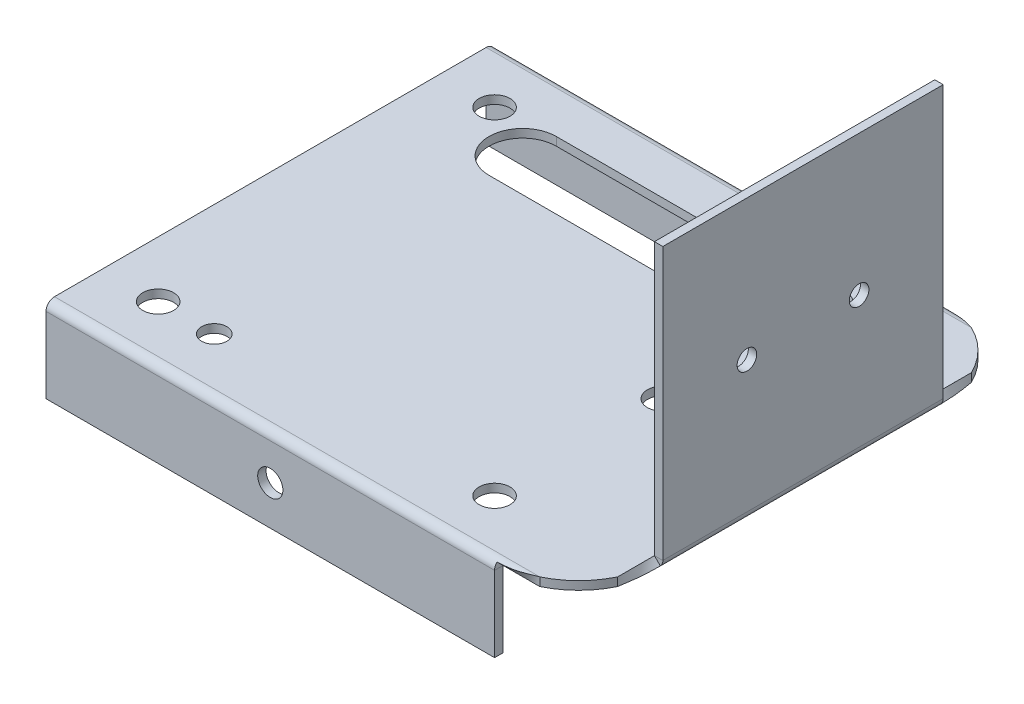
ISO-10303-21;
HEADER;
FILE_DESCRIPTION(('STEP AP214'),'2;1');
FILE_NAME('part.step','',(''),(''),'','','');
FILE_SCHEMA(('AUTOMOTIVE_DESIGN { 1 0 10303 214 1 1 1 1 }'));
ENDSEC;
DATA;
#1=APPLICATION_CONTEXT('core data for automotive mechanical design processes');
#2=APPLICATION_PROTOCOL_DEFINITION('international standard','automotive_design',2000,#1);
#3=PRODUCT_CONTEXT('',#1,'mechanical');
#4=PRODUCT('Part','Part','',(#3));
#5=PRODUCT_RELATED_PRODUCT_CATEGORY('part','',(#4));
#6=PRODUCT_DEFINITION_FORMATION('','',#4);
#7=PRODUCT_DEFINITION_CONTEXT('part definition',#1,'design');
#8=PRODUCT_DEFINITION('design','',#6,#7);
#9=PRODUCT_DEFINITION_SHAPE('','',#8);
#10=(LENGTH_UNIT() NAMED_UNIT(*) SI_UNIT(.MILLI.,.METRE.));
#11=(NAMED_UNIT(*) PLANE_ANGLE_UNIT() SI_UNIT($,.RADIAN.));
#12=(NAMED_UNIT(*) SI_UNIT($,.STERADIAN.) SOLID_ANGLE_UNIT());
#13=UNCERTAINTY_MEASURE_WITH_UNIT(LENGTH_MEASURE(1.E-05),#10,'distance_accuracy_value','');
#14=(GEOMETRIC_REPRESENTATION_CONTEXT(3) GLOBAL_UNCERTAINTY_ASSIGNED_CONTEXT((#13)) GLOBAL_UNIT_ASSIGNED_CONTEXT((#10,
#11,#12)) REPRESENTATION_CONTEXT('',''));
#15=CARTESIAN_POINT('',(0.,0.,0.));
#16=DIRECTION('',(0.,0.,1.));
#17=DIRECTION('',(1.,0.,0.));
#18=AXIS2_PLACEMENT_3D('',#15,#16,#17);
#19=CARTESIAN_POINT('',(80.,0.,25.));
#20=DIRECTION('',(0.,-1.,0.));
#21=DIRECTION('',(0.,0.,-1.));
#22=AXIS2_PLACEMENT_3D('',#19,#20,#21);
#23=PLANE('',#22);
#24=CARTESIAN_POINT('',(70.,0.,0.));
#25=DIRECTION('',(0.,1.,0.));
#26=DIRECTION('',(0.,0.,1.));
#27=AXIS2_PLACEMENT_3D('',#24,#25,#26);
#28=CIRCLE('',#27,2.75000000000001);
#29=CARTESIAN_POINT('',(70.,0.,2.75000000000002));
#30=VERTEX_POINT('',#29);
#31=EDGE_CURVE('E657',#30,#30,#28,.T.);
#32=ORIENTED_EDGE('',*,*,#31,.T.);
#33=EDGE_LOOP('',(#32));
#34=FACE_BOUND('',#33,.T.);
#35=CARTESIAN_POINT('',(20.,0.,30.));
#36=DIRECTION('',(0.,1.,0.));
#37=DIRECTION('',(0.,0.,1.));
#38=AXIS2_PLACEMENT_3D('',#35,#36,#37);
#39=CIRCLE('',#38,2.25);
#40=CARTESIAN_POINT('',(20.,0.,32.25));
#41=VERTEX_POINT('',#40);
#42=EDGE_CURVE('E654',#41,#41,#39,.T.);
#43=ORIENTED_EDGE('',*,*,#42,.T.);
#44=EDGE_LOOP('',(#43));
#45=FACE_BOUND('',#44,.T.);
#46=CARTESIAN_POINT('',(10.,0.,-30.));
#47=DIRECTION('',(0.,1.,0.));
#48=DIRECTION('',(0.,0.,1.));
#49=AXIS2_PLACEMENT_3D('',#46,#47,#48);
#50=CIRCLE('',#49,2.75);
#51=CARTESIAN_POINT('',(10.,0.,-27.25));
#52=VERTEX_POINT('',#51);
#53=EDGE_CURVE('E651',#52,#52,#50,.T.);
#54=ORIENTED_EDGE('',*,*,#53,.T.);
#55=EDGE_LOOP('',(#54));
#56=FACE_BOUND('',#55,.T.);
#57=DIRECTION('',(-1.,0.,0.));
#58=VECTOR('',#57,1.);
#59=CARTESIAN_POINT('',(20.,0.,-31.));
#60=LINE('',#59,#58);
#61=CARTESIAN_POINT('',(55.,0.,-31.));
#62=VERTEX_POINT('',#61);
#63=CARTESIAN_POINT('',(20.,0.,-31.));
#64=VERTEX_POINT('',#63);
#65=EDGE_CURVE('E648',#62,#64,#60,.T.);
#66=ORIENTED_EDGE('',*,*,#65,.T.);
#67=CARTESIAN_POINT('',(20.,0.,-25.));
#68=DIRECTION('',(0.,1.,0.));
#69=DIRECTION('',(0.,0.,1.));
#70=AXIS2_PLACEMENT_3D('',#67,#68,#69);
#71=CIRCLE('',#70,6.);
#72=CARTESIAN_POINT('',(20.,0.,-19.));
#73=VERTEX_POINT('',#72);
#74=EDGE_CURVE('E645',#64,#73,#71,.T.);
#75=ORIENTED_EDGE('',*,*,#74,.T.);
#76=DIRECTION('',(1.,0.,0.));
#77=VECTOR('',#76,1.);
#78=CARTESIAN_POINT('',(20.,0.,-19.));
#79=LINE('',#78,#77);
#80=CARTESIAN_POINT('',(55.,0.,-19.));
#81=VERTEX_POINT('',#80);
#82=EDGE_CURVE('E642',#73,#81,#79,.T.);
#83=ORIENTED_EDGE('',*,*,#82,.T.);
#84=CARTESIAN_POINT('',(55.,0.,-25.));
#85=DIRECTION('',(0.,1.,0.));
#86=DIRECTION('',(0.,0.,1.));
#87=AXIS2_PLACEMENT_3D('',#84,#85,#86);
#88=CIRCLE('',#87,6.);
#89=EDGE_CURVE('E639',#81,#62,#88,.T.);
#90=ORIENTED_EDGE('',*,*,#89,.T.);
#91=EDGE_LOOP('',(#66,#75,#83,#90));
#92=FACE_BOUND('',#91,.T.);
#93=CARTESIAN_POINT('',(10.,0.,30.));
#94=DIRECTION('',(0.,1.,0.));
#95=DIRECTION('',(0.,0.,1.));
#96=AXIS2_PLACEMENT_3D('',#93,#94,#95);
#97=CIRCLE('',#96,2.75);
#98=CARTESIAN_POINT('',(10.,0.,32.75));
#99=VERTEX_POINT('',#98);
#100=EDGE_CURVE('E636',#99,#99,#97,.T.);
#101=ORIENTED_EDGE('',*,*,#100,.T.);
#102=EDGE_LOOP('',(#101));
#103=FACE_BOUND('',#102,.T.);
#104=CARTESIAN_POINT('',(70.,0.,-30.));
#105=DIRECTION('',(0.,1.,0.));
#106=DIRECTION('',(0.,0.,1.));
#107=AXIS2_PLACEMENT_3D('',#104,#105,#106);
#108=CIRCLE('',#107,2.75000000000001);
#109=CARTESIAN_POINT('',(70.,0.,-27.25));
#110=VERTEX_POINT('',#109);
#111=EDGE_CURVE('E633',#110,#110,#108,.T.);
#112=ORIENTED_EDGE('',*,*,#111,.T.);
#113=EDGE_LOOP('',(#112));
#114=FACE_BOUND('',#113,.T.);
#115=CARTESIAN_POINT('',(70.,0.,30.));
#116=DIRECTION('',(0.,1.,0.));
#117=DIRECTION('',(0.,0.,1.));
#118=AXIS2_PLACEMENT_3D('',#115,#116,#117);
#119=CIRCLE('',#118,2.75000000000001);
#120=CARTESIAN_POINT('',(70.,0.,32.75));
#121=VERTEX_POINT('',#120);
#122=EDGE_CURVE('E624',#121,#121,#119,.T.);
#123=ORIENTED_EDGE('',*,*,#122,.T.);
#124=EDGE_LOOP('',(#123));
#125=FACE_BOUND('',#124,.T.);
#126=CARTESIAN_POINT('',(80.,0.,25.));
#127=DIRECTION('',(0.,1.,0.));
#128=DIRECTION('',(0.,0.,-1.));
#129=AXIS2_PLACEMENT_3D('',#126,#127,#128);
#130=CIRCLE('',#129,15.);
#131=CARTESIAN_POINT('',(86.5486620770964,0.,38.495));
#132=VERTEX_POINT('',#131);
#133=CARTESIAN_POINT('',(93.495,0.,31.5486620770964));
#134=VERTEX_POINT('',#133);
#135=EDGE_CURVE('E85',#132,#134,#130,.T.);
#136=ORIENTED_EDGE('',*,*,#135,.F.);
#137=DIRECTION('',(-1.,0.,0.));
#138=VECTOR('',#137,1.);
#139=CARTESIAN_POINT('',(80.,0.,38.495));
#140=LINE('',#139,#138);
#141=CARTESIAN_POINT('',(0.,0.,38.495));
#142=VERTEX_POINT('',#141);
#143=EDGE_CURVE('E78',#132,#142,#140,.T.);
#144=ORIENTED_EDGE('',*,*,#143,.T.);
#145=DIRECTION('',(0.,0.,1.));
#146=VECTOR('',#145,1.);
#147=CARTESIAN_POINT('',(0.,0.,-55.));
#148=LINE('',#147,#146);
#149=CARTESIAN_POINT('',(0.,0.,-38.495));
#150=VERTEX_POINT('',#149);
#151=EDGE_CURVE('E93',#150,#142,#148,.T.);
#152=ORIENTED_EDGE('',*,*,#151,.F.);
#153=DIRECTION('',(-1.,0.,0.));
#154=VECTOR('',#153,1.);
#155=CARTESIAN_POINT('',(80.,0.,-38.495));
#156=LINE('',#155,#154);
#157=CARTESIAN_POINT('',(86.5486620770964,2.69462321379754E-08,-38.495));
#158=VERTEX_POINT('',#157);
#159=EDGE_CURVE('E724',#158,#150,#156,.T.);
#160=ORIENTED_EDGE('',*,*,#159,.F.);
#161=CARTESIAN_POINT('',(80.,0.,-25.));
#162=DIRECTION('',(0.,1.,0.));
#163=DIRECTION('',(0.,0.,1.));
#164=AXIS2_PLACEMENT_3D('',#161,#162,#163);
#165=CIRCLE('',#164,15.);
#166=CARTESIAN_POINT('',(93.495,0.,-31.5486620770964));
#167=VERTEX_POINT('',#166);
#168=EDGE_CURVE('E660',#167,#158,#165,.T.);
#169=ORIENTED_EDGE('',*,*,#168,.F.);
#170=DIRECTION('',(0.,0.,1.));
#171=VECTOR('',#170,1.);
#172=CARTESIAN_POINT('',(93.495,0.,25.));
#173=LINE('',#172,#171);
#174=EDGE_CURVE('E632',#167,#134,#173,.T.);
#175=ORIENTED_EDGE('',*,*,#174,.T.);
#176=EDGE_LOOP('',(#136,#144,#152,#160,#169,#175));
#177=FACE_BOUND('',#176,.T.);
#178=ADVANCED_FACE('F70',(#34,#45,#56,#92,#103,#114,#125,#177),#23,.T.);
#179=CARTESIAN_POINT('',(80.,1.5,-25.));
#180=DIRECTION('',(0.,-1.,0.));
#181=DIRECTION('',(0.,0.,-1.));
#182=AXIS2_PLACEMENT_3D('',#179,#180,#181);
#183=CYLINDRICAL_SURFACE('',#182,15.);
#184=ORIENTED_EDGE('',*,*,#168,.T.);
#185=CARTESIAN_POINT('',(86.5486620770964,1.50000002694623,-38.495));
#186=CARTESIAN_POINT('',(86.5486620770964,2.69462321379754E-08,-38.495));
#187=B_SPLINE_CURVE_WITH_KNOTS('',1,(#185,#186),.UNSPECIFIED.,.F.,.F.,(2,2),(0.,1.),.UNSPECIFIED.);
#188=CARTESIAN_POINT('',(86.5486620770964,1.50000002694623,-38.495));
#189=VERTEX_POINT('',#188);
#190=EDGE_CURVE('E477',#158,#189,#187,.F.);
#191=ORIENTED_EDGE('',*,*,#190,.T.);
#192=CARTESIAN_POINT('',(80.,1.5,-25.));
#193=DIRECTION('',(0.,1.,0.));
#194=DIRECTION('',(0.,0.,1.));
#195=AXIS2_PLACEMENT_3D('',#192,#193,#194);
#196=CIRCLE('',#195,15.);
#197=CARTESIAN_POINT('',(93.495,1.49999993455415,-31.5486620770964));
#198=VERTEX_POINT('',#197);
#199=EDGE_CURVE('E699',#198,#189,#196,.T.);
#200=ORIENTED_EDGE('',*,*,#199,.F.);
#201=CARTESIAN_POINT('',(93.495,-6.54458499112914E-08,-31.5486620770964));
#202=CARTESIAN_POINT('',(93.495,1.49999993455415,-31.5486620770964));
#203=B_SPLINE_CURVE_WITH_KNOTS('',1,(#201,#202),.UNSPECIFIED.,.F.,.F.,(2,2),(0.,1.),.UNSPECIFIED.);
#204=EDGE_CURVE('E698',#167,#198,#203,.T.);
#205=ORIENTED_EDGE('',*,*,#204,.F.);
#206=EDGE_LOOP('',(#184,#191,#200,#205));
#207=FACE_BOUND('',#206,.T.);
#208=ADVANCED_FACE('F726',(#207),#183,.T.);
#209=CARTESIAN_POINT('',(80.,1.5,25.));
#210=DIRECTION('',(0.,-1.,0.));
#211=DIRECTION('',(0.,0.,-1.));
#212=AXIS2_PLACEMENT_3D('',#209,#210,#211);
#213=PLANE('',#212);
#214=DIRECTION('',(-1.,0.,0.));
#215=VECTOR('',#214,1.);
#216=CARTESIAN_POINT('',(80.,1.5,38.495));
#217=LINE('',#216,#215);
#218=CARTESIAN_POINT('',(86.5486620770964,1.50000002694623,38.495));
#219=VERTEX_POINT('',#218);
#220=CARTESIAN_POINT('',(0.,1.5,38.495));
#221=VERTEX_POINT('',#220);
#222=EDGE_CURVE('E823',#219,#221,#217,.T.);
#223=ORIENTED_EDGE('',*,*,#222,.F.);
#224=CARTESIAN_POINT('',(80.,1.5,25.));
#225=DIRECTION('',(0.,1.,0.));
#226=DIRECTION('',(0.,0.,-1.));
#227=AXIS2_PLACEMENT_3D('',#224,#225,#226);
#228=CIRCLE('',#227,15.);
#229=CARTESIAN_POINT('',(93.495,1.5,31.5486620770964));
#230=VERTEX_POINT('',#229);
#231=EDGE_CURVE('E757',#219,#230,#228,.T.);
#232=ORIENTED_EDGE('',*,*,#231,.T.);
#233=DIRECTION('',(0.,0.,1.));
#234=VECTOR('',#233,1.);
#235=CARTESIAN_POINT('',(93.495,1.5,25.));
#236=LINE('',#235,#234);
#237=EDGE_CURVE('E704',#198,#230,#236,.T.);
#238=ORIENTED_EDGE('',*,*,#237,.F.);
#239=ORIENTED_EDGE('',*,*,#199,.T.);
#240=DIRECTION('',(-1.,0.,0.));
#241=VECTOR('',#240,1.);
#242=CARTESIAN_POINT('',(80.,1.5,-38.495));
#243=LINE('',#242,#241);
#244=CARTESIAN_POINT('',(0.,1.50000001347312,-38.495));
#245=VERTEX_POINT('',#244);
#246=EDGE_CURVE('E711',#189,#245,#243,.T.);
#247=ORIENTED_EDGE('',*,*,#246,.T.);
#248=DIRECTION('',(0.,0.,1.));
#249=VECTOR('',#248,1.);
#250=CARTESIAN_POINT('',(0.,1.5,-55.));
#251=LINE('',#250,#249);
#252=EDGE_CURVE('E703',#245,#221,#251,.T.);
#253=ORIENTED_EDGE('',*,*,#252,.T.);
#254=EDGE_LOOP('',(#223,#232,#238,#239,#247,#253));
#255=FACE_BOUND('',#254,.T.);
#256=CARTESIAN_POINT('',(70.,1.5,30.));
#257=DIRECTION('',(0.,1.,0.));
#258=DIRECTION('',(0.,0.,1.));
#259=AXIS2_PLACEMENT_3D('',#256,#257,#258);
#260=CIRCLE('',#259,2.75000000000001);
#261=CARTESIAN_POINT('',(70.,1.5,32.75));
#262=VERTEX_POINT('',#261);
#263=EDGE_CURVE('E695',#262,#262,#260,.T.);
#264=ORIENTED_EDGE('',*,*,#263,.F.);
#265=EDGE_LOOP('',(#264));
#266=FACE_BOUND('',#265,.T.);
#267=CARTESIAN_POINT('',(70.,1.5,-30.));
#268=DIRECTION('',(0.,1.,0.));
#269=DIRECTION('',(0.,0.,1.));
#270=AXIS2_PLACEMENT_3D('',#267,#268,#269);
#271=CIRCLE('',#270,2.75000000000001);
#272=CARTESIAN_POINT('',(70.,1.5,-27.25));
#273=VERTEX_POINT('',#272);
#274=EDGE_CURVE('E692',#273,#273,#271,.T.);
#275=ORIENTED_EDGE('',*,*,#274,.F.);
#276=EDGE_LOOP('',(#275));
#277=FACE_BOUND('',#276,.T.);
#278=CARTESIAN_POINT('',(10.,1.5,30.));
#279=DIRECTION('',(0.,1.,0.));
#280=DIRECTION('',(0.,0.,1.));
#281=AXIS2_PLACEMENT_3D('',#278,#279,#280);
#282=CIRCLE('',#281,2.75);
#283=CARTESIAN_POINT('',(10.,1.5,32.75));
#284=VERTEX_POINT('',#283);
#285=EDGE_CURVE('E689',#284,#284,#282,.T.);
#286=ORIENTED_EDGE('',*,*,#285,.F.);
#287=EDGE_LOOP('',(#286));
#288=FACE_BOUND('',#287,.T.);
#289=CARTESIAN_POINT('',(20.,1.5,-25.));
#290=DIRECTION('',(0.,1.,0.));
#291=DIRECTION('',(0.,0.,1.));
#292=AXIS2_PLACEMENT_3D('',#289,#290,#291);
#293=CIRCLE('',#292,6.);
#294=CARTESIAN_POINT('',(20.,1.5,-31.));
#295=VERTEX_POINT('',#294);
#296=CARTESIAN_POINT('',(20.,1.5,-19.));
#297=VERTEX_POINT('',#296);
#298=EDGE_CURVE('E673',#295,#297,#293,.T.);
#299=ORIENTED_EDGE('',*,*,#298,.F.);
#300=DIRECTION('',(-1.,0.,0.));
#301=VECTOR('',#300,1.);
#302=CARTESIAN_POINT('',(20.,1.5,-31.));
#303=LINE('',#302,#301);
#304=CARTESIAN_POINT('',(55.,1.5,-31.));
#305=VERTEX_POINT('',#304);
#306=EDGE_CURVE('E678',#305,#295,#303,.T.);
#307=ORIENTED_EDGE('',*,*,#306,.F.);
#308=CARTESIAN_POINT('',(55.,1.5,-25.));
#309=DIRECTION('',(0.,1.,0.));
#310=DIRECTION('',(0.,0.,1.));
#311=AXIS2_PLACEMENT_3D('',#308,#309,#310);
#312=CIRCLE('',#311,6.);
#313=CARTESIAN_POINT('',(55.,1.5,-19.));
#314=VERTEX_POINT('',#313);
#315=EDGE_CURVE('E682',#314,#305,#312,.T.);
#316=ORIENTED_EDGE('',*,*,#315,.F.);
#317=DIRECTION('',(1.,0.,0.));
#318=VECTOR('',#317,1.);
#319=CARTESIAN_POINT('',(20.,1.5,-19.));
#320=LINE('',#319,#318);
#321=EDGE_CURVE('E687',#297,#314,#320,.T.);
#322=ORIENTED_EDGE('',*,*,#321,.F.);
#323=EDGE_LOOP('',(#299,#307,#316,#322));
#324=FACE_BOUND('',#323,.T.);
#325=CARTESIAN_POINT('',(10.,1.5,-30.));
#326=DIRECTION('',(0.,1.,0.));
#327=DIRECTION('',(0.,0.,1.));
#328=AXIS2_PLACEMENT_3D('',#325,#326,#327);
#329=CIRCLE('',#328,2.75);
#330=CARTESIAN_POINT('',(10.,1.5,-27.25));
#331=VERTEX_POINT('',#330);
#332=EDGE_CURVE('E667',#331,#331,#329,.T.);
#333=ORIENTED_EDGE('',*,*,#332,.F.);
#334=EDGE_LOOP('',(#333));
#335=FACE_BOUND('',#334,.T.);
#336=CARTESIAN_POINT('',(20.,1.5,30.));
#337=DIRECTION('',(0.,1.,0.));
#338=DIRECTION('',(0.,0.,1.));
#339=AXIS2_PLACEMENT_3D('',#336,#337,#338);
#340=CIRCLE('',#339,2.25);
#341=CARTESIAN_POINT('',(20.,1.5,32.25));
#342=VERTEX_POINT('',#341);
#343=EDGE_CURVE('E664',#342,#342,#340,.T.);
#344=ORIENTED_EDGE('',*,*,#343,.F.);
#345=EDGE_LOOP('',(#344));
#346=FACE_BOUND('',#345,.T.);
#347=CARTESIAN_POINT('',(70.,1.5,0.));
#348=DIRECTION('',(0.,1.,0.));
#349=DIRECTION('',(0.,0.,1.));
#350=AXIS2_PLACEMENT_3D('',#347,#348,#349);
#351=CIRCLE('',#350,2.75000000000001);
#352=CARTESIAN_POINT('',(70.,1.5,2.75000000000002));
#353=VERTEX_POINT('',#352);
#354=EDGE_CURVE('E661',#353,#353,#351,.T.);
#355=ORIENTED_EDGE('',*,*,#354,.F.);
#356=EDGE_LOOP('',(#355));
#357=FACE_BOUND('',#356,.T.);
#358=ADVANCED_FACE('F736',(#255,#266,#277,#288,#324,#335,#346,#357),#213,.F.);
#359=CARTESIAN_POINT('',(0.,1.5,-55.));
#360=DIRECTION('',(1.,0.,0.));
#361=DIRECTION('',(0.,0.,-1.));
#362=AXIS2_PLACEMENT_3D('',#359,#360,#361);
#363=PLANE('',#362);
#364=DIRECTION('',(0.,-1.,0.));
#365=VECTOR('',#364,1.);
#366=CARTESIAN_POINT('',(0.,1.50000000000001,38.495));
#367=LINE('',#366,#365);
#368=EDGE_CURVE('E818',#221,#142,#367,.T.);
#369=ORIENTED_EDGE('',*,*,#368,.F.);
#370=ORIENTED_EDGE('',*,*,#252,.F.);
#371=DIRECTION('',(0.,-1.,0.));
#372=VECTOR('',#371,1.);
#373=CARTESIAN_POINT('',(0.,1.5,-38.495));
#374=LINE('',#373,#372);
#375=EDGE_CURVE('E826',#245,#150,#374,.T.);
#376=ORIENTED_EDGE('',*,*,#375,.T.);
#377=ORIENTED_EDGE('',*,*,#151,.T.);
#378=EDGE_LOOP('',(#369,#370,#376,#377));
#379=FACE_BOUND('',#378,.T.);
#380=ADVANCED_FACE('F1012',(#379),#363,.F.);
#381=CARTESIAN_POINT('',(93.5049999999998,50.005,25.));
#382=DIRECTION('',(0.,0.,-1.));
#383=DIRECTION('',(0.,-1.,0.));
#384=AXIS2_PLACEMENT_3D('',#381,#382,#383);
#385=PLANE('',#384);
#386=DIRECTION('',(0.,1.,0.));
#387=VECTOR('',#386,1.);
#388=CARTESIAN_POINT('',(93.5049999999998,50.005,25.));
#389=LINE('',#388,#387);
#390=CARTESIAN_POINT('',(93.505,1.51,25.));
#391=VERTEX_POINT('',#390);
#392=CARTESIAN_POINT('',(93.5049999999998,50.005,25.));
#393=VERTEX_POINT('',#392);
#394=EDGE_CURVE('E794',#391,#393,#389,.T.);
#395=ORIENTED_EDGE('',*,*,#394,.F.);
#396=DIRECTION('',(1.,0.,0.));
#397=VECTOR('',#396,1.);
#398=CARTESIAN_POINT('',(93.505,1.51,25.));
#399=LINE('',#398,#397);
#400=CARTESIAN_POINT('',(95.0050000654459,1.50999999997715,25.));
#401=VERTEX_POINT('',#400);
#402=EDGE_CURVE('E714',#391,#401,#399,.T.);
#403=ORIENTED_EDGE('',*,*,#402,.T.);
#404=DIRECTION('',(0.,1.,0.));
#405=VECTOR('',#404,1.);
#406=CARTESIAN_POINT('',(95.0049999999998,50.005,25.));
#407=LINE('',#406,#405);
#408=CARTESIAN_POINT('',(95.0049999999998,50.005,25.));
#409=VERTEX_POINT('',#408);
#410=EDGE_CURVE('E789',#401,#409,#407,.T.);
#411=ORIENTED_EDGE('',*,*,#410,.T.);
#412=DIRECTION('',(1.,0.,0.));
#413=VECTOR('',#412,1.);
#414=CARTESIAN_POINT('',(93.5049999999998,50.005,25.));
#415=LINE('',#414,#413);
#416=EDGE_CURVE('E790',#393,#409,#415,.T.);
#417=ORIENTED_EDGE('',*,*,#416,.F.);
#418=EDGE_LOOP('',(#395,#403,#411,#417));
#419=FACE_BOUND('',#418,.T.);
#420=ADVANCED_FACE('F737',(#419),#385,.F.);
#421=CARTESIAN_POINT('',(93.5049999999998,50.005,-25.));
#422=DIRECTION('',(0.,0.,1.));
#423=DIRECTION('',(0.,1.,0.));
#424=AXIS2_PLACEMENT_3D('',#421,#422,#423);
#425=PLANE('',#424);
#426=DIRECTION('',(0.,-1.,0.));
#427=VECTOR('',#426,1.);
#428=CARTESIAN_POINT('',(95.0049999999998,50.005,-25.));
#429=LINE('',#428,#427);
#430=CARTESIAN_POINT('',(95.0049999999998,50.005,-25.));
#431=VERTEX_POINT('',#430);
#432=CARTESIAN_POINT('',(95.0050000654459,1.51,-25.));
#433=VERTEX_POINT('',#432);
#434=EDGE_CURVE('E785',#431,#433,#429,.T.);
#435=ORIENTED_EDGE('',*,*,#434,.T.);
#436=DIRECTION('',(-1.,0.,0.));
#437=VECTOR('',#436,1.);
#438=CARTESIAN_POINT('',(93.505,1.51,-25.));
#439=LINE('',#438,#437);
#440=CARTESIAN_POINT('',(93.5050000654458,1.51,-25.));
#441=VERTEX_POINT('',#440);
#442=EDGE_CURVE('E800',#433,#441,#439,.T.);
#443=ORIENTED_EDGE('',*,*,#442,.T.);
#444=DIRECTION('',(0.,-1.,0.));
#445=VECTOR('',#444,1.);
#446=CARTESIAN_POINT('',(93.5049999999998,50.005,-25.));
#447=LINE('',#446,#445);
#448=CARTESIAN_POINT('',(93.5049999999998,50.005,-25.));
#449=VERTEX_POINT('',#448);
#450=EDGE_CURVE('E788',#449,#441,#447,.T.);
#451=ORIENTED_EDGE('',*,*,#450,.F.);
#452=DIRECTION('',(1.,0.,0.));
#453=VECTOR('',#452,1.);
#454=CARTESIAN_POINT('',(93.5049999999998,50.005,-25.));
#455=LINE('',#454,#453);
#456=EDGE_CURVE('E793',#449,#431,#455,.T.);
#457=ORIENTED_EDGE('',*,*,#456,.T.);
#458=EDGE_LOOP('',(#435,#443,#451,#457));
#459=FACE_BOUND('',#458,.T.);
#460=ADVANCED_FACE('F923',(#459),#425,.F.);
#461=CARTESIAN_POINT('',(93.5050000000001,-14.995,25.));
#462=DIRECTION('',(1.,0.,0.));
#463=DIRECTION('',(0.,0.,-1.));
#464=AXIS2_PLACEMENT_3D('',#461,#462,#463);
#465=PLANE('',#464);
#466=CARTESIAN_POINT('',(93.5049999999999,25.005,-10.));
#467=DIRECTION('',(-1.,0.,0.));
#468=DIRECTION('',(0.,0.,1.));
#469=AXIS2_PLACEMENT_3D('',#466,#467,#468);
#470=CIRCLE('',#469,1.75);
#471=CARTESIAN_POINT('',(93.5049999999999,25.005,-8.25));
#472=VERTEX_POINT('',#471);
#473=EDGE_CURVE('E774',#472,#472,#470,.T.);
#474=ORIENTED_EDGE('',*,*,#473,.F.);
#475=EDGE_LOOP('',(#474));
#476=FACE_BOUND('',#475,.T.);
#477=CARTESIAN_POINT('',(93.5049999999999,25.005,10.));
#478=DIRECTION('',(-1.,0.,0.));
#479=DIRECTION('',(0.,0.,1.));
#480=AXIS2_PLACEMENT_3D('',#477,#478,#479);
#481=CIRCLE('',#480,1.75);
#482=CARTESIAN_POINT('',(93.5049999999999,25.005,11.75));
#483=VERTEX_POINT('',#482);
#484=EDGE_CURVE('E780',#483,#483,#481,.T.);
#485=ORIENTED_EDGE('',*,*,#484,.F.);
#486=EDGE_LOOP('',(#485));
#487=FACE_BOUND('',#486,.T.);
#488=ORIENTED_EDGE('',*,*,#450,.T.);
#489=DIRECTION('',(0.,0.,1.));
#490=VECTOR('',#489,1.);
#491=CARTESIAN_POINT('',(93.505,1.51,25.));
#492=LINE('',#491,#490);
#493=EDGE_CURVE('E797',#441,#391,#492,.T.);
#494=ORIENTED_EDGE('',*,*,#493,.T.);
#495=ORIENTED_EDGE('',*,*,#394,.T.);
#496=DIRECTION('',(0.,0.,-1.));
#497=VECTOR('',#496,1.);
#498=CARTESIAN_POINT('',(93.5049999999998,50.005,0.));
#499=LINE('',#498,#497);
#500=EDGE_CURVE('E786',#393,#449,#499,.T.);
#501=ORIENTED_EDGE('',*,*,#500,.T.);
#502=EDGE_LOOP('',(#488,#494,#495,#501));
#503=FACE_BOUND('',#502,.T.);
#504=ADVANCED_FACE('F913',(#476,#487,#503),#465,.F.);
#505=CARTESIAN_POINT('',(95.0050000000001,-14.995,25.));
#506=DIRECTION('',(1.,0.,0.));
#507=DIRECTION('',(0.,0.,-1.));
#508=AXIS2_PLACEMENT_3D('',#505,#506,#507);
#509=PLANE('',#508);
#510=DIRECTION('',(0.,0.,1.));
#511=VECTOR('',#510,1.);
#512=CARTESIAN_POINT('',(95.005,1.51,25.));
#513=LINE('',#512,#511);
#514=EDGE_CURVE('E803',#433,#401,#513,.T.);
#515=ORIENTED_EDGE('',*,*,#514,.F.);
#516=ORIENTED_EDGE('',*,*,#434,.F.);
#517=DIRECTION('',(0.,0.,-1.));
#518=VECTOR('',#517,1.);
#519=CARTESIAN_POINT('',(95.0049999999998,50.005,0.));
#520=LINE('',#519,#518);
#521=EDGE_CURVE('E783',#409,#431,#520,.T.);
#522=ORIENTED_EDGE('',*,*,#521,.F.);
#523=ORIENTED_EDGE('',*,*,#410,.F.);
#524=EDGE_LOOP('',(#515,#516,#522,#523));
#525=FACE_BOUND('',#524,.T.);
#526=CARTESIAN_POINT('',(95.0049999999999,25.005,10.));
#527=DIRECTION('',(-1.,0.,0.));
#528=DIRECTION('',(0.,0.,1.));
#529=AXIS2_PLACEMENT_3D('',#526,#527,#528);
#530=CIRCLE('',#529,1.75);
#531=CARTESIAN_POINT('',(95.0049999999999,25.005,11.75));
#532=VERTEX_POINT('',#531);
#533=EDGE_CURVE('E777',#532,#532,#530,.T.);
#534=ORIENTED_EDGE('',*,*,#533,.T.);
#535=EDGE_LOOP('',(#534));
#536=FACE_BOUND('',#535,.T.);
#537=CARTESIAN_POINT('',(95.0049999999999,25.005,-10.));
#538=DIRECTION('',(-1.,0.,0.));
#539=DIRECTION('',(0.,0.,1.));
#540=AXIS2_PLACEMENT_3D('',#537,#538,#539);
#541=CIRCLE('',#540,1.75);
#542=CARTESIAN_POINT('',(95.0049999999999,25.005,-8.25));
#543=VERTEX_POINT('',#542);
#544=EDGE_CURVE('E766',#543,#543,#541,.T.);
#545=ORIENTED_EDGE('',*,*,#544,.T.);
#546=EDGE_LOOP('',(#545));
#547=FACE_BOUND('',#546,.T.);
#548=ADVANCED_FACE('F928',(#525,#536,#547),#509,.T.);
#549=CARTESIAN_POINT('',(93.5049999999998,50.005,0.));
#550=DIRECTION('',(0.,-1.,0.));
#551=DIRECTION('',(0.,0.,1.));
#552=AXIS2_PLACEMENT_3D('',#549,#550,#551);
#553=PLANE('',#552);
#554=ORIENTED_EDGE('',*,*,#521,.T.);
#555=ORIENTED_EDGE('',*,*,#456,.F.);
#556=ORIENTED_EDGE('',*,*,#500,.F.);
#557=ORIENTED_EDGE('',*,*,#416,.T.);
#558=EDGE_LOOP('',(#554,#555,#556,#557));
#559=FACE_BOUND('',#558,.T.);
#560=ADVANCED_FACE('F920',(#559),#553,.F.);
#561=CARTESIAN_POINT('',(93.5049999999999,25.005,10.));
#562=DIRECTION('',(1.,0.,0.));
#563=DIRECTION('',(0.,0.,-1.));
#564=AXIS2_PLACEMENT_3D('',#561,#562,#563);
#565=CYLINDRICAL_SURFACE('',#564,1.75);
#566=ORIENTED_EDGE('',*,*,#484,.T.);
#567=EDGE_LOOP('',(#566));
#568=FACE_BOUND('',#567,.T.);
#569=ORIENTED_EDGE('',*,*,#533,.F.);
#570=EDGE_LOOP('',(#569));
#571=FACE_BOUND('',#570,.T.);
#572=ADVANCED_FACE('F938',(#568,#571),#565,.F.);
#573=CARTESIAN_POINT('',(93.5049999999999,25.005,-10.));
#574=DIRECTION('',(1.,0.,0.));
#575=DIRECTION('',(0.,0.,-1.));
#576=AXIS2_PLACEMENT_3D('',#573,#574,#575);
#577=CYLINDRICAL_SURFACE('',#576,1.75);
#578=ORIENTED_EDGE('',*,*,#473,.T.);
#579=EDGE_LOOP('',(#578));
#580=FACE_BOUND('',#579,.T.);
#581=ORIENTED_EDGE('',*,*,#544,.F.);
#582=EDGE_LOOP('',(#581));
#583=FACE_BOUND('',#582,.T.);
#584=ADVANCED_FACE('F935',(#580,#583),#577,.F.);
#585=CARTESIAN_POINT('',(70.,1.5,30.));
#586=DIRECTION('',(0.,-1.,0.));
#587=DIRECTION('',(0.,0.,-1.));
#588=AXIS2_PLACEMENT_3D('',#585,#586,#587);
#589=CYLINDRICAL_SURFACE('',#588,2.75000000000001);
#590=ORIENTED_EDGE('',*,*,#263,.T.);
#591=EDGE_LOOP('',(#590));
#592=FACE_BOUND('',#591,.T.);
#593=ORIENTED_EDGE('',*,*,#122,.F.);
#594=EDGE_LOOP('',(#593));
#595=FACE_BOUND('',#594,.T.);
#596=ADVANCED_FACE('F937',(#592,#595),#589,.F.);
#597=CARTESIAN_POINT('',(70.,1.5,-30.));
#598=DIRECTION('',(0.,-1.,0.));
#599=DIRECTION('',(0.,0.,-1.));
#600=AXIS2_PLACEMENT_3D('',#597,#598,#599);
#601=CYLINDRICAL_SURFACE('',#600,2.75000000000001);
#602=ORIENTED_EDGE('',*,*,#274,.T.);
#603=EDGE_LOOP('',(#602));
#604=FACE_BOUND('',#603,.T.);
#605=ORIENTED_EDGE('',*,*,#111,.F.);
#606=EDGE_LOOP('',(#605));
#607=FACE_BOUND('',#606,.T.);
#608=ADVANCED_FACE('F945',(#604,#607),#601,.F.);
#609=CARTESIAN_POINT('',(10.,1.5,30.));
#610=DIRECTION('',(0.,-1.,0.));
#611=DIRECTION('',(0.,0.,-1.));
#612=AXIS2_PLACEMENT_3D('',#609,#610,#611);
#613=CYLINDRICAL_SURFACE('',#612,2.75);
#614=ORIENTED_EDGE('',*,*,#285,.T.);
#615=EDGE_LOOP('',(#614));
#616=FACE_BOUND('',#615,.T.);
#617=ORIENTED_EDGE('',*,*,#100,.F.);
#618=EDGE_LOOP('',(#617));
#619=FACE_BOUND('',#618,.T.);
#620=ADVANCED_FACE('F970',(#616,#619),#613,.F.);
#621=CARTESIAN_POINT('',(20.,1.5,-19.));
#622=DIRECTION('',(0.,0.,-1.));
#623=DIRECTION('',(-1.,0.,0.));
#624=AXIS2_PLACEMENT_3D('',#621,#622,#623);
#625=PLANE('',#624);
#626=ORIENTED_EDGE('',*,*,#82,.F.);
#627=DIRECTION('',(0.,-1.,0.));
#628=VECTOR('',#627,1.);
#629=CARTESIAN_POINT('',(20.,1.5,-19.));
#630=LINE('',#629,#628);
#631=EDGE_CURVE('E670',#297,#73,#630,.T.);
#632=ORIENTED_EDGE('',*,*,#631,.F.);
#633=ORIENTED_EDGE('',*,*,#321,.T.);
#634=DIRECTION('',(0.,-1.,0.));
#635=VECTOR('',#634,1.);
#636=CARTESIAN_POINT('',(55.,1.5,-19.));
#637=LINE('',#636,#635);
#638=EDGE_CURVE('E685',#314,#81,#637,.T.);
#639=ORIENTED_EDGE('',*,*,#638,.T.);
#640=EDGE_LOOP('',(#626,#632,#633,#639));
#641=FACE_BOUND('',#640,.T.);
#642=ADVANCED_FACE('F976',(#641),#625,.T.);
#643=CARTESIAN_POINT('',(55.,1.5,-25.));
#644=DIRECTION('',(0.,-1.,0.));
#645=DIRECTION('',(0.,0.,-1.));
#646=AXIS2_PLACEMENT_3D('',#643,#644,#645);
#647=CYLINDRICAL_SURFACE('',#646,6.);
#648=ORIENTED_EDGE('',*,*,#89,.F.);
#649=ORIENTED_EDGE('',*,*,#638,.F.);
#650=ORIENTED_EDGE('',*,*,#315,.T.);
#651=DIRECTION('',(0.,-1.,0.));
#652=VECTOR('',#651,1.);
#653=CARTESIAN_POINT('',(55.,1.5,-31.));
#654=LINE('',#653,#652);
#655=EDGE_CURVE('E680',#305,#62,#654,.T.);
#656=ORIENTED_EDGE('',*,*,#655,.T.);
#657=EDGE_LOOP('',(#648,#649,#650,#656));
#658=FACE_BOUND('',#657,.T.);
#659=ADVANCED_FACE('F982',(#658),#647,.F.);
#660=CARTESIAN_POINT('',(20.,1.5,-31.));
#661=DIRECTION('',(0.,0.,1.));
#662=DIRECTION('',(1.,0.,0.));
#663=AXIS2_PLACEMENT_3D('',#660,#661,#662);
#664=PLANE('',#663);
#665=ORIENTED_EDGE('',*,*,#65,.F.);
#666=ORIENTED_EDGE('',*,*,#655,.F.);
#667=ORIENTED_EDGE('',*,*,#306,.T.);
#668=DIRECTION('',(0.,-1.,0.));
#669=VECTOR('',#668,1.);
#670=CARTESIAN_POINT('',(20.,1.5,-31.));
#671=LINE('',#670,#669);
#672=EDGE_CURVE('E675',#295,#64,#671,.T.);
#673=ORIENTED_EDGE('',*,*,#672,.T.);
#674=EDGE_LOOP('',(#665,#666,#667,#673));
#675=FACE_BOUND('',#674,.T.);
#676=ADVANCED_FACE('F986',(#675),#664,.T.);
#677=CARTESIAN_POINT('',(20.,1.5,-25.));
#678=DIRECTION('',(0.,-1.,0.));
#679=DIRECTION('',(0.,0.,-1.));
#680=AXIS2_PLACEMENT_3D('',#677,#678,#679);
#681=CYLINDRICAL_SURFACE('',#680,6.);
#682=ORIENTED_EDGE('',*,*,#74,.F.);
#683=ORIENTED_EDGE('',*,*,#672,.F.);
#684=ORIENTED_EDGE('',*,*,#298,.T.);
#685=ORIENTED_EDGE('',*,*,#631,.T.);
#686=EDGE_LOOP('',(#682,#683,#684,#685));
#687=FACE_BOUND('',#686,.T.);
#688=ADVANCED_FACE('F990',(#687),#681,.F.);
#689=CARTESIAN_POINT('',(10.,1.5,-30.));
#690=DIRECTION('',(0.,-1.,0.));
#691=DIRECTION('',(0.,0.,-1.));
#692=AXIS2_PLACEMENT_3D('',#689,#690,#691);
#693=CYLINDRICAL_SURFACE('',#692,2.75);
#694=ORIENTED_EDGE('',*,*,#332,.T.);
#695=EDGE_LOOP('',(#694));
#696=FACE_BOUND('',#695,.T.);
#697=ORIENTED_EDGE('',*,*,#53,.F.);
#698=EDGE_LOOP('',(#697));
#699=FACE_BOUND('',#698,.T.);
#700=ADVANCED_FACE('F994',(#696,#699),#693,.F.);
#701=CARTESIAN_POINT('',(20.,1.5,30.));
#702=DIRECTION('',(0.,-1.,0.));
#703=DIRECTION('',(0.,0.,-1.));
#704=AXIS2_PLACEMENT_3D('',#701,#702,#703);
#705=CYLINDRICAL_SURFACE('',#704,2.25);
#706=ORIENTED_EDGE('',*,*,#343,.T.);
#707=EDGE_LOOP('',(#706));
#708=FACE_BOUND('',#707,.T.);
#709=ORIENTED_EDGE('',*,*,#42,.F.);
#710=EDGE_LOOP('',(#709));
#711=FACE_BOUND('',#710,.T.);
#712=ADVANCED_FACE('F998',(#708,#711),#705,.F.);
#713=CARTESIAN_POINT('',(70.,1.5,0.));
#714=DIRECTION('',(0.,-1.,0.));
#715=DIRECTION('',(0.,0.,-1.));
#716=AXIS2_PLACEMENT_3D('',#713,#714,#715);
#717=CYLINDRICAL_SURFACE('',#716,2.75000000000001);
#718=ORIENTED_EDGE('',*,*,#354,.T.);
#719=EDGE_LOOP('',(#718));
#720=FACE_BOUND('',#719,.T.);
#721=ORIENTED_EDGE('',*,*,#31,.F.);
#722=EDGE_LOOP('',(#721));
#723=FACE_BOUND('',#722,.T.);
#724=ADVANCED_FACE('F1001',(#720,#723),#717,.F.);
#725=CARTESIAN_POINT('',(80.,1.5,25.));
#726=DIRECTION('',(0.,-1.,0.));
#727=DIRECTION('',(0.,0.,-1.));
#728=AXIS2_PLACEMENT_3D('',#725,#726,#727);
#729=CYLINDRICAL_SURFACE('',#728,15.);
#730=CARTESIAN_POINT('',(86.5486620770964,2.69462321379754E-08,38.495));
#731=CARTESIAN_POINT('',(86.5486620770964,1.50000002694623,38.495));
#732=B_SPLINE_CURVE_WITH_KNOTS('',1,(#730,#731),.UNSPECIFIED.,.F.,.F.,(2,2),(0.,1.),.UNSPECIFIED.);
#733=EDGE_CURVE('E12',#132,#219,#732,.T.);
#734=ORIENTED_EDGE('',*,*,#733,.F.);
#735=ORIENTED_EDGE('',*,*,#135,.T.);
#736=CARTESIAN_POINT('',(93.495,1.49999993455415,31.5486620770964));
#737=CARTESIAN_POINT('',(93.495,-6.54458499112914E-08,31.5486620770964));
#738=B_SPLINE_CURVE_WITH_KNOTS('',1,(#736,#737),.UNSPECIFIED.,.F.,.F.,(2,2),(0.,1.),.UNSPECIFIED.);
#739=EDGE_CURVE('E762',#230,#134,#738,.T.);
#740=ORIENTED_EDGE('',*,*,#739,.F.);
#741=ORIENTED_EDGE('',*,*,#231,.F.);
#742=EDGE_LOOP('',(#734,#735,#740,#741));
#743=FACE_BOUND('',#742,.T.);
#744=ADVANCED_FACE('F580',(#743),#729,.T.);
#745=CARTESIAN_POINT('',(94.5627312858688,0.442268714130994,-25.));
#746=CARTESIAN_POINT('',(94.4229647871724,0.302502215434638,-26.0914499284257));
#747=CARTESIAN_POINT('',(94.2554646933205,0.190582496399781,-27.1828873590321));
#748=CARTESIAN_POINT('',(93.8902393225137,0.0393011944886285,-29.3657747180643));
#749=CARTESIAN_POINT('',(93.6926596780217,-6.5445849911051E-08,-30.4572121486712));
#750=CARTESIAN_POINT('',(93.495,-6.54458499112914E-08,-31.5486620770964));
#751=CARTESIAN_POINT('',(93.5020711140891,1.50292888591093,-25.));
#752=CARTESIAN_POINT('',(93.501145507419,1.5020032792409,-26.0914436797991));
#753=CARTESIAN_POINT('',(93.5000362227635,1.50126207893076,-27.1828873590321));
#754=CARTESIAN_POINT('',(93.4976174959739,1.50026020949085,-29.3657747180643));
#755=CARTESIAN_POINT('',(93.4963090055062,1.49999993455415,-30.4572183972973));
#756=CARTESIAN_POINT('',(93.495,1.49999993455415,-31.5486620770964));
#757=B_SPLINE_SURFACE_WITH_KNOTS('',1,3,((#745,#746,#747,#748,#749,#750),(#751,#752,#753,#754,
#755,#756)),.UNSPECIFIED.,.F.,.F.,.F.,(2,2),(4,2,4),(0.,1.),(0.,0.5,1.),.UNSPECIFIED.);
#758=CARTESIAN_POINT('',(93.5020711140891,1.50292888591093,-25.));
#759=CARTESIAN_POINT('',(94.5627312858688,0.442268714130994,-25.));
#760=B_SPLINE_CURVE_WITH_KNOTS('',1,(#758,#759),.UNSPECIFIED.,.F.,.F.,(2,2),(0.,1.),.UNSPECIFIED.);
#761=CARTESIAN_POINT('',(94.5627312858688,0.442268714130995,-25.));
#762=VERTEX_POINT('',#761);
#763=CARTESIAN_POINT('',(93.5020711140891,1.50292888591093,-25.));
#764=VERTEX_POINT('',#763);
#765=EDGE_CURVE('E612',#762,#764,#760,.F.);
#766=CARTESIAN_POINT('',(94.5627312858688,0.442268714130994,-25.));
#767=CARTESIAN_POINT('',(94.4229647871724,0.302502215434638,-26.0914499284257));
#768=CARTESIAN_POINT('',(94.2554646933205,0.190582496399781,-27.1828873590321));
#769=CARTESIAN_POINT('',(93.8902393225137,0.0393011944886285,-29.3657747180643));
#770=CARTESIAN_POINT('',(93.6926596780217,-6.5445849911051E-08,-30.4572121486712));
#771=CARTESIAN_POINT('',(93.495,-6.54458499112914E-08,-31.5486620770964));
#772=B_SPLINE_CURVE_WITH_KNOTS('',3,(#766,#767,#768,#769,#770,#771),.UNSPECIFIED.,.F.,.F.,(4,2,
4),(0.,0.5,1.),.UNSPECIFIED.);
#773=EDGE_CURVE('E547',#762,#167,#772,.T.);
#774=CARTESIAN_POINT('',(93.495,1.49999993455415,-31.5486620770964));
#775=CARTESIAN_POINT('',(93.4963090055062,1.49999993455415,-30.4572183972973));
#776=CARTESIAN_POINT('',(93.4976174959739,1.50026020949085,-29.3657747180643));
#777=CARTESIAN_POINT('',(93.5000362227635,1.50126207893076,-27.1828873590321));
#778=CARTESIAN_POINT('',(93.501145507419,1.5020032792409,-26.0914436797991));
#779=CARTESIAN_POINT('',(93.5020711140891,1.50292888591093,-25.));
#780=B_SPLINE_CURVE_WITH_KNOTS('',3,(#774,#775,#776,#777,#778,#779),.UNSPECIFIED.,.F.,.F.,(4,2,
4),(0.,0.5,1.),.UNSPECIFIED.);
#781=EDGE_CURVE('E535',#764,#198,#780,.F.);
#782=ORIENTED_EDGE('',*,*,#765,.F.);
#783=ORIENTED_EDGE('',*,*,#773,.T.);
#784=ORIENTED_EDGE('',*,*,#204,.T.);
#785=ORIENTED_EDGE('',*,*,#781,.F.);
#786=EDGE_LOOP('',(#782,#783,#784,#785));
#787=FACE_BOUND('',#786,.T.);
#788=ADVANCED_FACE('F568',(#787),#757,.F.);
#789=CARTESIAN_POINT('',(93.495,-6.54458499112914E-08,31.5486620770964));
#790=CARTESIAN_POINT('',(93.6926596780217,-6.5445849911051E-08,30.4572121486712));
#791=CARTESIAN_POINT('',(93.8902393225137,0.0393011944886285,29.3657747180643));
#792=CARTESIAN_POINT('',(94.2554646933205,0.190582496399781,27.1828873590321));
#793=CARTESIAN_POINT('',(94.4229647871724,0.302502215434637,26.0914499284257));
#794=CARTESIAN_POINT('',(94.5627312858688,0.442268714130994,25.));
#795=CARTESIAN_POINT('',(93.495,1.49999993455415,31.5486620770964));
#796=CARTESIAN_POINT('',(93.4963090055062,1.49999993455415,30.4572183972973));
#797=CARTESIAN_POINT('',(93.4976174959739,1.50026020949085,29.3657747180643));
#798=CARTESIAN_POINT('',(93.5000362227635,1.50126207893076,27.1828873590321));
#799=CARTESIAN_POINT('',(93.501145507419,1.5020032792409,26.0914436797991));
#800=CARTESIAN_POINT('',(93.5020711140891,1.50292888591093,25.));
#801=B_SPLINE_SURFACE_WITH_KNOTS('',1,3,((#789,#790,#791,#792,#793,#794),(#795,#796,#797,#798,
#799,#800)),.UNSPECIFIED.,.F.,.F.,.F.,(2,2),(4,2,4),(0.,1.),(0.,0.5,1.),.UNSPECIFIED.);
#802=CARTESIAN_POINT('',(93.495,-6.54458499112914E-08,31.5486620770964));
#803=CARTESIAN_POINT('',(93.6926596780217,-6.5445849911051E-08,30.4572121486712));
#804=CARTESIAN_POINT('',(93.8902393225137,0.0393011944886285,29.3657747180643));
#805=CARTESIAN_POINT('',(94.2554646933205,0.190582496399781,27.1828873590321));
#806=CARTESIAN_POINT('',(94.4229647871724,0.302502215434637,26.0914499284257));
#807=CARTESIAN_POINT('',(94.5627312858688,0.442268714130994,25.));
#808=B_SPLINE_CURVE_WITH_KNOTS('',3,(#802,#803,#804,#805,#806,#807),.UNSPECIFIED.,.F.,.F.,(4,2,
4),(0.,0.5,1.),.UNSPECIFIED.);
#809=CARTESIAN_POINT('',(94.5627312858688,0.442268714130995,25.));
#810=VERTEX_POINT('',#809);
#811=EDGE_CURVE('E491',#134,#810,#808,.T.);
#812=CARTESIAN_POINT('',(94.5627312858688,0.442268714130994,25.));
#813=CARTESIAN_POINT('',(93.5020711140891,1.50292888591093,25.));
#814=B_SPLINE_CURVE_WITH_KNOTS('',1,(#812,#813),.UNSPECIFIED.,.F.,.F.,(2,2),(0.,1.),.UNSPECIFIED.);
#815=CARTESIAN_POINT('',(93.5020711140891,1.50292888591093,25.));
#816=VERTEX_POINT('',#815);
#817=EDGE_CURVE('E538',#810,#816,#814,.T.);
#818=CARTESIAN_POINT('',(93.5020711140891,1.50292888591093,25.));
#819=CARTESIAN_POINT('',(93.501145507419,1.5020032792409,26.0914436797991));
#820=CARTESIAN_POINT('',(93.5000362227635,1.50126207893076,27.1828873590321));
#821=CARTESIAN_POINT('',(93.4976174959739,1.50026020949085,29.3657747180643));
#822=CARTESIAN_POINT('',(93.4963090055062,1.49999993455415,30.4572183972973));
#823=CARTESIAN_POINT('',(93.495,1.49999993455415,31.5486620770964));
#824=B_SPLINE_CURVE_WITH_KNOTS('',3,(#818,#819,#820,#821,#822,#823),.UNSPECIFIED.,.F.,.F.,(4,2,
4),(0.,0.5,1.),.UNSPECIFIED.);
#825=EDGE_CURVE('E899',#230,#816,#824,.F.);
#826=ORIENTED_EDGE('',*,*,#739,.T.);
#827=ORIENTED_EDGE('',*,*,#811,.T.);
#828=ORIENTED_EDGE('',*,*,#817,.T.);
#829=ORIENTED_EDGE('',*,*,#825,.F.);
#830=EDGE_LOOP('',(#826,#827,#828,#829));
#831=FACE_BOUND('',#830,.T.);
#832=ADVANCED_FACE('F579',(#831),#801,.F.);
#833=CARTESIAN_POINT('',(93.495,1.51000006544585,25.));
#834=DIRECTION('',(0.,0.,-1.));
#835=DIRECTION('',(-1.,0.,0.));
#836=AXIS2_PLACEMENT_3D('',#833,#834,#835);
#837=PLANE('',#836);
#838=ORIENTED_EDGE('',*,*,#817,.F.);
#839=CARTESIAN_POINT('',(93.495,1.51,25.));
#840=DIRECTION('',(0.,0.,-1.));
#841=DIRECTION('',(-1.,0.,0.));
#842=AXIS2_PLACEMENT_3D('',#839,#840,#841);
#843=CIRCLE('',#842,1.51000006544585);
#844=EDGE_CURVE('E482',#810,#401,#843,.F.);
#845=ORIENTED_EDGE('',*,*,#844,.T.);
#846=ORIENTED_EDGE('',*,*,#402,.F.);
#847=CARTESIAN_POINT('',(93.495,1.51000006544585,25.));
#848=DIRECTION('',(0.,0.,1.));
#849=DIRECTION('',(1.,0.,0.));
#850=AXIS2_PLACEMENT_3D('',#847,#848,#849);
#851=CIRCLE('',#850,0.0100000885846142);
#852=EDGE_CURVE('E498',#816,#391,#851,.T.);
#853=ORIENTED_EDGE('',*,*,#852,.F.);
#854=EDGE_LOOP('',(#838,#845,#846,#853));
#855=FACE_BOUND('',#854,.T.);
#856=ADVANCED_FACE('F512',(#855),#837,.F.);
#857=CARTESIAN_POINT('',(93.495,1.51000006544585,-25.));
#858=DIRECTION('',(0.,0.,1.));
#859=DIRECTION('',(1.,0.,0.));
#860=AXIS2_PLACEMENT_3D('',#857,#858,#859);
#861=PLANE('',#860);
#862=CARTESIAN_POINT('',(93.495,1.51,-25.));
#863=DIRECTION('',(0.,0.,-1.));
#864=DIRECTION('',(-1.,0.,0.));
#865=AXIS2_PLACEMENT_3D('',#862,#863,#864);
#866=CIRCLE('',#865,1.51000006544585);
#867=EDGE_CURVE('E490',#433,#762,#866,.T.);
#868=ORIENTED_EDGE('',*,*,#867,.T.);
#869=ORIENTED_EDGE('',*,*,#765,.T.);
#870=CARTESIAN_POINT('',(93.495,1.51000006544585,-25.));
#871=DIRECTION('',(0.,0.,-1.));
#872=DIRECTION('',(-1.,0.,0.));
#873=AXIS2_PLACEMENT_3D('',#870,#871,#872);
#874=CIRCLE('',#873,0.0100000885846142);
#875=EDGE_CURVE('E536',#441,#764,#874,.T.);
#876=ORIENTED_EDGE('',*,*,#875,.F.);
#877=ORIENTED_EDGE('',*,*,#442,.F.);
#878=EDGE_LOOP('',(#868,#869,#876,#877));
#879=FACE_BOUND('',#878,.T.);
#880=ADVANCED_FACE('F510',(#879),#861,.F.);
#881=CARTESIAN_POINT('',(93.495,1.51,63.1868848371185));
#882=DIRECTION('',(0.,0.,-1.));
#883=DIRECTION('',(-1.,0.,0.));
#884=AXIS2_PLACEMENT_3D('',#881,#882,#883);
#885=CYLINDRICAL_SURFACE('',#884,0.0100000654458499);
#886=ORIENTED_EDGE('',*,*,#493,.F.);
#887=ORIENTED_EDGE('',*,*,#875,.T.);
#888=ORIENTED_EDGE('',*,*,#781,.T.);
#889=ORIENTED_EDGE('',*,*,#237,.T.);
#890=ORIENTED_EDGE('',*,*,#825,.T.);
#891=ORIENTED_EDGE('',*,*,#852,.T.);
#892=EDGE_LOOP('',(#886,#887,#888,#889,#890,#891));
#893=FACE_BOUND('',#892,.T.);
#894=ADVANCED_FACE('F501',(#893),#885,.F.);
#895=CARTESIAN_POINT('',(93.495,1.51,63.1868848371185));
#896=DIRECTION('',(0.,0.,-1.));
#897=DIRECTION('',(-1.,0.,0.));
#898=AXIS2_PLACEMENT_3D('',#895,#896,#897);
#899=CYLINDRICAL_SURFACE('',#898,1.51000006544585);
#900=ORIENTED_EDGE('',*,*,#514,.T.);
#901=ORIENTED_EDGE('',*,*,#844,.F.);
#902=ORIENTED_EDGE('',*,*,#811,.F.);
#903=ORIENTED_EDGE('',*,*,#174,.F.);
#904=ORIENTED_EDGE('',*,*,#773,.F.);
#905=ORIENTED_EDGE('',*,*,#867,.F.);
#906=EDGE_LOOP('',(#900,#901,#902,#903,#904,#905));
#907=FACE_BOUND('',#906,.T.);
#908=ADVANCED_FACE('F455',(#907),#899,.T.);
#909=CARTESIAN_POINT('',(80.,-0.0100000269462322,-38.495));
#910=DIRECTION('',(1.,0.,0.));
#911=DIRECTION('',(0.,0.,-1.));
#912=AXIS2_PLACEMENT_3D('',#909,#910,#911);
#913=PLANE('',#912);
#914=CARTESIAN_POINT('',(80.,-0.00292891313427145,-38.5020710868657));
#915=CARTESIAN_POINT('',(80.,1.05773125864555,-39.5627312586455));
#916=B_SPLINE_CURVE_WITH_KNOTS('',1,(#914,#915),.UNSPECIFIED.,.F.,.F.,(2,2),(0.,1.),.UNSPECIFIED.);
#917=CARTESIAN_POINT('',(80.,-0.00292891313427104,-38.5020710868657));
#918=VERTEX_POINT('',#917);
#919=CARTESIAN_POINT('',(80.,1.057731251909,-39.562731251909));
#920=VERTEX_POINT('',#919);
#921=EDGE_CURVE('E898',#918,#920,#916,.T.);
#922=ORIENTED_EDGE('',*,*,#921,.F.);
#923=CARTESIAN_POINT('',(80.,-0.01,-38.495));
#924=DIRECTION('',(-1.,0.,0.));
#925=DIRECTION('',(0.,0.,1.));
#926=AXIS2_PLACEMENT_3D('',#923,#924,#925);
#927=CIRCLE('',#926,0.0100000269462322);
#928=CARTESIAN_POINT('',(80.,-0.00999999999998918,-38.505));
#929=VERTEX_POINT('',#928);
#930=EDGE_CURVE('E374',#918,#929,#927,.T.);
#931=ORIENTED_EDGE('',*,*,#930,.T.);
#932=DIRECTION('',(0.,0.,-1.));
#933=VECTOR('',#932,1.);
#934=CARTESIAN_POINT('',(80.,-0.00999999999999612,-40.005));
#935=LINE('',#934,#933);
#936=CARTESIAN_POINT('',(80.,-0.0100000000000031,-40.005));
#937=VERTEX_POINT('',#936);
#938=EDGE_CURVE('E401',#929,#937,#935,.T.);
#939=ORIENTED_EDGE('',*,*,#938,.T.);
#940=CARTESIAN_POINT('',(80.,-0.0100000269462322,-38.495));
#941=DIRECTION('',(-1.,0.,0.));
#942=DIRECTION('',(0.,0.,1.));
#943=AXIS2_PLACEMENT_3D('',#940,#941,#942);
#944=CIRCLE('',#943,1.51000003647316);
#945=EDGE_CURVE('E417',#920,#937,#944,.T.);
#946=ORIENTED_EDGE('',*,*,#945,.F.);
#947=EDGE_LOOP('',(#922,#931,#939,#946));
#948=FACE_BOUND('',#947,.T.);
#949=ADVANCED_FACE('F450',(#948),#913,.T.);
#950=CARTESIAN_POINT('',(0.,-0.0100000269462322,-38.495));
#951=DIRECTION('',(-1.,0.,0.));
#952=DIRECTION('',(0.,0.,1.));
#953=AXIS2_PLACEMENT_3D('',#950,#951,#952);
#954=PLANE('',#953);
#955=DIRECTION('',(0.,0.,1.));
#956=VECTOR('',#955,1.);
#957=CARTESIAN_POINT('',(0.,-0.00999999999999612,-40.005));
#958=LINE('',#957,#956);
#959=CARTESIAN_POINT('',(0.,-0.010000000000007,-40.0050000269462));
#960=VERTEX_POINT('',#959);
#961=CARTESIAN_POINT('',(0.,-0.00999999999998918,-38.505));
#962=VERTEX_POINT('',#961);
#963=EDGE_CURVE('E404',#960,#962,#958,.T.);
#964=ORIENTED_EDGE('',*,*,#963,.T.);
#965=CARTESIAN_POINT('',(0.,-0.01,-38.495));
#966=DIRECTION('',(-1.,0.,0.));
#967=DIRECTION('',(0.,0.,1.));
#968=AXIS2_PLACEMENT_3D('',#965,#966,#967);
#969=CIRCLE('',#968,0.0100000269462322);
#970=EDGE_CURVE('E410',#962,#150,#969,.F.);
#971=ORIENTED_EDGE('',*,*,#970,.T.);
#972=ORIENTED_EDGE('',*,*,#375,.F.);
#973=CARTESIAN_POINT('',(0.,-0.0100000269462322,-38.495));
#974=DIRECTION('',(1.,0.,0.));
#975=DIRECTION('',(0.,0.,-1.));
#976=AXIS2_PLACEMENT_3D('',#973,#974,#975);
#977=CIRCLE('',#976,1.51000004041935);
#978=EDGE_CURVE('E413',#960,#245,#977,.T.);
#979=ORIENTED_EDGE('',*,*,#978,.F.);
#980=EDGE_LOOP('',(#964,#971,#972,#979));
#981=FACE_BOUND('',#980,.T.);
#982=ADVANCED_FACE('F445',(#981),#954,.T.);
#983=CARTESIAN_POINT('',(86.5486620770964,1.50000002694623,-38.495));
#984=CARTESIAN_POINT('',(85.8524501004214,1.50000002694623,-38.7252552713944));
#985=CARTESIAN_POINT('',(85.2364615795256,1.44895084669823,-38.9118926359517));
#986=CARTESIAN_POINT('',(84.4314961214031,1.36665495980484,-39.1198843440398));
#987=CARTESIAN_POINT('',(84.1830837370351,1.33793825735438,-39.1777233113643));
#988=CARTESIAN_POINT('',(83.8403293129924,1.29854754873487,-39.2490162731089));
#989=CARTESIAN_POINT('',(83.7310551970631,1.28600806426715,-39.2702102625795));
#990=CARTESIAN_POINT('',(83.5746100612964,1.26858833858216,-39.2983889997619));
#991=CARTESIAN_POINT('',(83.5237060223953,1.26301203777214,-39.3071797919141));
#992=CARTESIAN_POINT('',(83.4492164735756,1.25504457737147,-39.3194914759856));
#993=CARTESIAN_POINT('',(83.424697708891,1.25245484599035,-39.3234496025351));
#994=CARTESIAN_POINT('',(83.3883861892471,1.2486751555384,-39.3291715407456));
#995=CARTESIAN_POINT('',(83.3763601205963,1.24743273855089,-39.3310429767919));
#996=CARTESIAN_POINT('',(83.3524635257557,1.24498377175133,-39.3347146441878));
#997=CARTESIAN_POINT('',(83.3422604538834,1.24394522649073,-39.3362653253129));
#998=CARTESIAN_POINT('',(82.4673468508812,1.15579319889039,-39.4672043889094));
#999=CARTESIAN_POINT('',(81.3577324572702,1.08511907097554,-39.5353434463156));
#1000=CARTESIAN_POINT('',(80.,1.05773125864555,-39.5627312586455));
#1001=CARTESIAN_POINT('',(86.5486620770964,2.69462321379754E-08,-38.495));
#1002=CARTESIAN_POINT('',(85.8527429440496,2.6946232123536E-08,-38.49652423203));
#1003=CARTESIAN_POINT('',(85.2364615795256,-0.000338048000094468,-38.497760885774));
#1004=CARTESIAN_POINT('',(84.4314961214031,-0.000883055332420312,-38.4991383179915));
#1005=CARTESIAN_POINT('',(84.1830837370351,-0.00107323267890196,-38.4995213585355));
#1006=CARTESIAN_POINT('',(83.8403293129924,-0.00133409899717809,-38.4999934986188));
#1007=CARTESIAN_POINT('',(83.7310551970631,-0.00141714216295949,-38.5001338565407));
#1008=CARTESIAN_POINT('',(83.5746100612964,-0.00153250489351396,-38.5003204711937));
#1009=CARTESIAN_POINT('',(83.5237060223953,-0.00156943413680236,-38.5003786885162));
#1010=CARTESIAN_POINT('',(83.4492164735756,-0.0016221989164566,-38.500460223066));
#1011=CARTESIAN_POINT('',(83.424697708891,-0.00163934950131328,-38.5004864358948));
#1012=CARTESIAN_POINT('',(83.3883861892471,-0.00166438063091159,-38.5005243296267));
#1013=CARTESIAN_POINT('',(83.3763601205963,-0.00167260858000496,-38.5005367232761));
#1014=CARTESIAN_POINT('',(83.3524635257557,-0.00168882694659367,-38.5005610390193));
#1015=CARTESIAN_POINT('',(83.3422604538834,-0.00169570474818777,-38.5005713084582));
#1016=CARTESIAN_POINT('',(82.4673468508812,-0.00227949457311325,-38.5014384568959));
#1017=CARTESIAN_POINT('',(81.3577467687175,-0.00274753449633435,-38.5018897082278));
#1018=CARTESIAN_POINT('',(80.,-0.00292891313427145,-38.5020710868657));
#1019=B_SPLINE_SURFACE_WITH_KNOTS('',1,3,((#983,#984,#985,#986,#987,#988,#989,#990,#991,#992,
#993,#994,#995,#996,#997,#998,#999,#1000),(#1001,#1002,#1003,#1004,#1005,#1006,#1007,#1008,
#1009,#1010,#1011,#1012,#1013,#1014,#1015,#1016,#1017,#1018)),.UNSPECIFIED.,.F.,.F.,.F.,(2,2),
(4,2,2,2,2,2,2,2,4),(0.,1.),(0.,0.25,0.375,0.4375,0.46875,0.484375,0.4921875,0.5,1.),.UNSPECIFIED.);
#1020=CARTESIAN_POINT('',(86.5486620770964,2.69462321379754E-08,-38.495));
#1021=CARTESIAN_POINT('',(85.8527429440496,2.6946232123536E-08,-38.49652423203));
#1022=CARTESIAN_POINT('',(85.2364615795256,-0.000338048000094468,-38.497760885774));
#1023=CARTESIAN_POINT('',(84.4314961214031,-0.000883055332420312,-38.4991383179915));
#1024=CARTESIAN_POINT('',(84.1830837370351,-0.00107323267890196,-38.4995213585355));
#1025=CARTESIAN_POINT('',(83.8403293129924,-0.00133409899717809,-38.4999934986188));
#1026=CARTESIAN_POINT('',(83.7310551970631,-0.00141714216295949,-38.5001338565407));
#1027=CARTESIAN_POINT('',(83.5746100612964,-0.00153250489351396,-38.5003204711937));
#1028=CARTESIAN_POINT('',(83.5237060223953,-0.00156943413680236,-38.5003786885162));
#1029=CARTESIAN_POINT('',(83.4492164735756,-0.0016221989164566,-38.500460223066));
#1030=CARTESIAN_POINT('',(83.424697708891,-0.00163934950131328,-38.5004864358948));
#1031=CARTESIAN_POINT('',(83.3883861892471,-0.00166438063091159,-38.5005243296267));
#1032=CARTESIAN_POINT('',(83.3763601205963,-0.00167260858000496,-38.5005367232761));
#1033=CARTESIAN_POINT('',(83.3524635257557,-0.00168882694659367,-38.5005610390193));
#1034=CARTESIAN_POINT('',(83.3422604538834,-0.00169570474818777,-38.5005713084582));
#1035=CARTESIAN_POINT('',(82.4673468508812,-0.00227949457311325,-38.5014384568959));
#1036=CARTESIAN_POINT('',(81.3577467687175,-0.00274753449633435,-38.5018897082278));
#1037=CARTESIAN_POINT('',(80.,-0.00292891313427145,-38.5020710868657));
#1038=B_SPLINE_CURVE_WITH_KNOTS('',3,(#1020,#1021,#1022,#1023,#1024,#1025,#1026,#1027,#1028,
#1029,#1030,#1031,#1032,#1033,#1034,#1035,#1036,#1037),.UNSPECIFIED.,.F.,.F.,(4,2,2,2,2,2,2,2,
4),(0.,0.25,0.375,0.4375,0.46875,0.484375,0.4921875,0.5,1.),.UNSPECIFIED.);
#1039=EDGE_CURVE('E412',#158,#918,#1038,.T.);
#1040=CARTESIAN_POINT('',(80.,1.05773125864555,-39.5627312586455));
#1041=CARTESIAN_POINT('',(81.3577324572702,1.08511907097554,-39.5353434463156));
#1042=CARTESIAN_POINT('',(82.4673468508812,1.15579319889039,-39.4672043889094));
#1043=CARTESIAN_POINT('',(83.3422604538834,1.24394522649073,-39.3362653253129));
#1044=CARTESIAN_POINT('',(83.3524635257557,1.24498377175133,-39.3347146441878));
#1045=CARTESIAN_POINT('',(83.3763601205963,1.24743273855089,-39.3310429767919));
#1046=CARTESIAN_POINT('',(83.3883861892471,1.2486751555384,-39.3291715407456));
#1047=CARTESIAN_POINT('',(83.424697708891,1.25245484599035,-39.3234496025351));
#1048=CARTESIAN_POINT('',(83.4492164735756,1.25504457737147,-39.3194914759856));
#1049=CARTESIAN_POINT('',(83.5237060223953,1.26301203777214,-39.3071797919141));
#1050=CARTESIAN_POINT('',(83.5746100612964,1.26858833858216,-39.2983889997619));
#1051=CARTESIAN_POINT('',(83.7310551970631,1.28600806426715,-39.2702102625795));
#1052=CARTESIAN_POINT('',(83.8403293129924,1.29854754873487,-39.2490162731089));
#1053=CARTESIAN_POINT('',(84.1830837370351,1.33793825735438,-39.1777233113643));
#1054=CARTESIAN_POINT('',(84.4314961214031,1.36665495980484,-39.1198843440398));
#1055=CARTESIAN_POINT('',(85.2364615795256,1.44895084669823,-38.9118926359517));
#1056=CARTESIAN_POINT('',(85.8524501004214,1.50000002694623,-38.7252552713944));
#1057=CARTESIAN_POINT('',(86.5486620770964,1.50000002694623,-38.495));
#1058=B_SPLINE_CURVE_WITH_KNOTS('',3,(#1040,#1041,#1042,#1043,#1044,#1045,#1046,#1047,#1048,
#1049,#1050,#1051,#1052,#1053,#1054,#1055,#1056,#1057),.UNSPECIFIED.,.F.,.F.,(4,2,2,2,2,2,2,2,
4),(0.,0.5,0.5078125,0.515625,0.53125,0.5625,0.625,0.75,1.),.UNSPECIFIED.);
#1059=EDGE_CURVE('E416',#189,#920,#1058,.F.);
#1060=ORIENTED_EDGE('',*,*,#1039,.T.);
#1061=ORIENTED_EDGE('',*,*,#921,.T.);
#1062=ORIENTED_EDGE('',*,*,#1059,.F.);
#1063=ORIENTED_EDGE('',*,*,#190,.F.);
#1064=EDGE_LOOP('',(#1060,#1061,#1062,#1063));
#1065=FACE_BOUND('',#1064,.T.);
#1066=ADVANCED_FACE('F443',(#1065),#1019,.T.);
#1067=CARTESIAN_POINT('',(129.888308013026,-0.01,-38.495));
#1068=DIRECTION('',(-1.,0.,0.));
#1069=DIRECTION('',(0.,0.,1.));
#1070=AXIS2_PLACEMENT_3D('',#1067,#1068,#1069);
#1071=CYLINDRICAL_SURFACE('',#1070,1.51000002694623);
#1072=ORIENTED_EDGE('',*,*,#246,.F.);
#1073=ORIENTED_EDGE('',*,*,#1059,.T.);
#1074=ORIENTED_EDGE('',*,*,#945,.T.);
#1075=DIRECTION('',(-1.,0.,0.));
#1076=VECTOR('',#1075,1.);
#1077=CARTESIAN_POINT('',(80.,-0.0100000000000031,-40.005));
#1078=LINE('',#1077,#1076);
#1079=EDGE_CURVE('E407',#937,#960,#1078,.T.);
#1080=ORIENTED_EDGE('',*,*,#1079,.T.);
#1081=ORIENTED_EDGE('',*,*,#978,.T.);
#1082=EDGE_LOOP('',(#1072,#1073,#1074,#1080,#1081));
#1083=FACE_BOUND('',#1082,.T.);
#1084=ADVANCED_FACE('F432',(#1083),#1071,.T.);
#1085=CARTESIAN_POINT('',(129.888308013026,-0.01,-38.495));
#1086=DIRECTION('',(-1.,0.,0.));
#1087=DIRECTION('',(0.,0.,1.));
#1088=AXIS2_PLACEMENT_3D('',#1085,#1086,#1087);
#1089=CYLINDRICAL_SURFACE('',#1088,0.0100000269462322);
#1090=ORIENTED_EDGE('',*,*,#159,.T.);
#1091=ORIENTED_EDGE('',*,*,#970,.F.);
#1092=DIRECTION('',(-1.,0.,0.));
#1093=VECTOR('',#1092,1.);
#1094=CARTESIAN_POINT('',(80.,-0.00999999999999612,-38.505));
#1095=LINE('',#1094,#1093);
#1096=EDGE_CURVE('E378',#929,#962,#1095,.T.);
#1097=ORIENTED_EDGE('',*,*,#1096,.F.);
#1098=ORIENTED_EDGE('',*,*,#930,.F.);
#1099=ORIENTED_EDGE('',*,*,#1039,.F.);
#1100=EDGE_LOOP('',(#1090,#1091,#1097,#1098,#1099));
#1101=FACE_BOUND('',#1100,.T.);
#1102=ADVANCED_FACE('F442',(#1101),#1089,.F.);
#1103=CARTESIAN_POINT('',(40.,-6.505,-40.005));
#1104=DIRECTION('',(0.,0.,1.));
#1105=DIRECTION('',(0.,-1.,0.));
#1106=AXIS2_PLACEMENT_3D('',#1103,#1104,#1105);
#1107=CYLINDRICAL_SURFACE('',#1106,2.25);
#1108=CARTESIAN_POINT('',(40.,-6.505,-40.005));
#1109=DIRECTION('',(0.,0.,-1.));
#1110=DIRECTION('',(0.,1.,0.));
#1111=AXIS2_PLACEMENT_3D('',#1108,#1109,#1110);
#1112=CIRCLE('',#1111,2.25);
#1113=CARTESIAN_POINT('',(40.,-4.25499999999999,-40.005));
#1114=VERTEX_POINT('',#1113);
#1115=EDGE_CURVE('E398',#1114,#1114,#1112,.T.);
#1116=ORIENTED_EDGE('',*,*,#1115,.T.);
#1117=EDGE_LOOP('',(#1116));
#1118=FACE_BOUND('',#1117,.T.);
#1119=CARTESIAN_POINT('',(40.,-6.50499999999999,-38.505));
#1120=DIRECTION('',(0.,0.,-1.));
#1121=DIRECTION('',(0.,1.,0.));
#1122=AXIS2_PLACEMENT_3D('',#1119,#1120,#1121);
#1123=CIRCLE('',#1122,2.25);
#1124=CARTESIAN_POINT('',(40.,-4.25499999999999,-38.505));
#1125=VERTEX_POINT('',#1124);
#1126=EDGE_CURVE('E381',#1125,#1125,#1123,.T.);
#1127=ORIENTED_EDGE('',*,*,#1126,.F.);
#1128=EDGE_LOOP('',(#1127));
#1129=FACE_BOUND('',#1128,.T.);
#1130=ADVANCED_FACE('F1226',(#1118,#1129),#1107,.F.);
#1131=CARTESIAN_POINT('',(0.,-13.505,-40.0049999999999));
#1132=DIRECTION('',(0.,1.,0.));
#1133=DIRECTION('',(1.,0.,0.));
#1134=AXIS2_PLACEMENT_3D('',#1131,#1132,#1133);
#1135=PLANE('',#1134);
#1136=DIRECTION('',(-1.,0.,0.));
#1137=VECTOR('',#1136,1.);
#1138=CARTESIAN_POINT('',(0.,-13.505,-38.5049999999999));
#1139=LINE('',#1138,#1137);
#1140=CARTESIAN_POINT('',(80.,-13.505,-38.5049999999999));
#1141=VERTEX_POINT('',#1140);
#1142=CARTESIAN_POINT('',(0.,-13.505,-38.5049999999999));
#1143=VERTEX_POINT('',#1142);
#1144=EDGE_CURVE('E396',#1141,#1143,#1139,.T.);
#1145=ORIENTED_EDGE('',*,*,#1144,.T.);
#1146=DIRECTION('',(0.,0.,1.));
#1147=VECTOR('',#1146,1.);
#1148=CARTESIAN_POINT('',(0.,-13.505,-40.0049999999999));
#1149=LINE('',#1148,#1147);
#1150=CARTESIAN_POINT('',(0.,-13.505,-40.0049999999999));
#1151=VERTEX_POINT('',#1150);
#1152=EDGE_CURVE('E375',#1151,#1143,#1149,.T.);
#1153=ORIENTED_EDGE('',*,*,#1152,.F.);
#1154=DIRECTION('',(-1.,0.,0.));
#1155=VECTOR('',#1154,1.);
#1156=CARTESIAN_POINT('',(0.,-13.505,-40.0049999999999));
#1157=LINE('',#1156,#1155);
#1158=CARTESIAN_POINT('',(80.,-13.505,-40.0049999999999));
#1159=VERTEX_POINT('',#1158);
#1160=EDGE_CURVE('E389',#1159,#1151,#1157,.T.);
#1161=ORIENTED_EDGE('',*,*,#1160,.F.);
#1162=DIRECTION('',(0.,0.,1.));
#1163=VECTOR('',#1162,1.);
#1164=CARTESIAN_POINT('',(80.,-13.505,-40.0049999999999));
#1165=LINE('',#1164,#1163);
#1166=EDGE_CURVE('E393',#1159,#1141,#1165,.T.);
#1167=ORIENTED_EDGE('',*,*,#1166,.T.);
#1168=EDGE_LOOP('',(#1145,#1153,#1161,#1167));
#1169=FACE_BOUND('',#1168,.T.);
#1170=ADVANCED_FACE('F1237',(#1169),#1135,.F.);
#1171=CARTESIAN_POINT('',(80.,66.495,-40.0050000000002));
#1172=DIRECTION('',(0.,0.,1.));
#1173=DIRECTION('',(0.,-1.,0.));
#1174=AXIS2_PLACEMENT_3D('',#1171,#1172,#1173);
#1175=PLANE('',#1174);
#1176=ORIENTED_EDGE('',*,*,#1079,.F.);
#1177=DIRECTION('',(0.,-1.,0.));
#1178=VECTOR('',#1177,1.);
#1179=CARTESIAN_POINT('',(80.,-13.505,-40.0049999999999));
#1180=LINE('',#1179,#1178);
#1181=EDGE_CURVE('E391',#937,#1159,#1180,.T.);
#1182=ORIENTED_EDGE('',*,*,#1181,.T.);
#1183=ORIENTED_EDGE('',*,*,#1160,.T.);
#1184=DIRECTION('',(0.,1.,0.));
#1185=VECTOR('',#1184,1.);
#1186=CARTESIAN_POINT('',(0.,-13.505,-40.0049999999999));
#1187=LINE('',#1186,#1185);
#1188=EDGE_CURVE('E386',#1151,#960,#1187,.T.);
#1189=ORIENTED_EDGE('',*,*,#1188,.T.);
#1190=EDGE_LOOP('',(#1176,#1182,#1183,#1189));
#1191=FACE_BOUND('',#1190,.T.);
#1192=ORIENTED_EDGE('',*,*,#1115,.F.);
#1193=EDGE_LOOP('',(#1192));
#1194=FACE_BOUND('',#1193,.T.);
#1195=ADVANCED_FACE('F1247',(#1191,#1194),#1175,.F.);
#1196=CARTESIAN_POINT('',(80.,-13.505,-40.0049999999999));
#1197=DIRECTION('',(-1.,0.,0.));
#1198=DIRECTION('',(0.,1.,0.));
#1199=AXIS2_PLACEMENT_3D('',#1196,#1197,#1198);
#1200=PLANE('',#1199);
#1201=ORIENTED_EDGE('',*,*,#938,.F.);
#1202=DIRECTION('',(0.,-1.,0.));
#1203=VECTOR('',#1202,1.);
#1204=CARTESIAN_POINT('',(80.,-13.505,-38.5049999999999));
#1205=LINE('',#1204,#1203);
#1206=EDGE_CURVE('E384',#929,#1141,#1205,.T.);
#1207=ORIENTED_EDGE('',*,*,#1206,.T.);
#1208=ORIENTED_EDGE('',*,*,#1166,.F.);
#1209=ORIENTED_EDGE('',*,*,#1181,.F.);
#1210=EDGE_LOOP('',(#1201,#1207,#1208,#1209));
#1211=FACE_BOUND('',#1210,.T.);
#1212=ADVANCED_FACE('F1258',(#1211),#1200,.F.);
#1213=CARTESIAN_POINT('',(80.,66.495,-38.5050000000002));
#1214=DIRECTION('',(0.,0.,1.));
#1215=DIRECTION('',(0.,-1.,0.));
#1216=AXIS2_PLACEMENT_3D('',#1213,#1214,#1215);
#1217=PLANE('',#1216);
#1218=ORIENTED_EDGE('',*,*,#1126,.T.);
#1219=EDGE_LOOP('',(#1218));
#1220=FACE_BOUND('',#1219,.T.);
#1221=ORIENTED_EDGE('',*,*,#1206,.F.);
#1222=ORIENTED_EDGE('',*,*,#1096,.T.);
#1223=DIRECTION('',(0.,1.,0.));
#1224=VECTOR('',#1223,1.);
#1225=CARTESIAN_POINT('',(0.,-13.505,-38.5049999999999));
#1226=LINE('',#1225,#1224);
#1227=EDGE_CURVE('E367',#1143,#962,#1226,.T.);
#1228=ORIENTED_EDGE('',*,*,#1227,.F.);
#1229=ORIENTED_EDGE('',*,*,#1144,.F.);
#1230=EDGE_LOOP('',(#1221,#1222,#1228,#1229));
#1231=FACE_BOUND('',#1230,.T.);
#1232=ADVANCED_FACE('F1269',(#1220,#1231),#1217,.T.);
#1233=CARTESIAN_POINT('',(0.,-13.505,-40.0049999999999));
#1234=DIRECTION('',(1.,0.,0.));
#1235=DIRECTION('',(0.,-1.,0.));
#1236=AXIS2_PLACEMENT_3D('',#1233,#1234,#1235);
#1237=PLANE('',#1236);
#1238=ORIENTED_EDGE('',*,*,#963,.F.);
#1239=ORIENTED_EDGE('',*,*,#1188,.F.);
#1240=ORIENTED_EDGE('',*,*,#1152,.T.);
#1241=ORIENTED_EDGE('',*,*,#1227,.T.);
#1242=EDGE_LOOP('',(#1238,#1239,#1240,#1241));
#1243=FACE_BOUND('',#1242,.T.);
#1244=ADVANCED_FACE('F317',(#1243),#1237,.F.);
#1245=CARTESIAN_POINT('',(80.,1.05773125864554,39.5627312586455));
#1246=CARTESIAN_POINT('',(80.7112638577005,1.07603908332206,39.544423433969));
#1247=CARTESIAN_POINT('',(81.3443405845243,1.10199837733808,39.5177007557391));
#1248=CARTESIAN_POINT('',(82.1766728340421,1.14954861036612,39.4625414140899));
#1249=CARTESIAN_POINT('',(82.4345698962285,1.16681320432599,39.4416293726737));
#1250=CARTESIAN_POINT('',(82.7920949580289,1.19426284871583,39.4060846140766));
#1251=CARTESIAN_POINT('',(82.9063832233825,1.20366992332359,39.3935398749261));
#1252=CARTESIAN_POINT('',(83.0704854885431,1.21808000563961,39.3736277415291));
#1253=CARTESIAN_POINT('',(83.123964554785,1.22293316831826,39.3668078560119));
#1254=CARTESIAN_POINT('',(83.2023506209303,1.23027581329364,39.3562980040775));
#1255=CARTESIAN_POINT('',(83.2281738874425,1.23273383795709,39.3527480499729));
#1256=CARTESIAN_POINT('',(83.2664506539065,1.23643504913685,39.3473523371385));
#1257=CARTESIAN_POINT('',(83.2791332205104,1.23767114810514,39.3455419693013));
#1258=CARTESIAN_POINT('',(83.3043456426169,1.24014780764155,39.3418975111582));
#1259=CARTESIAN_POINT('',(83.3159993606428,1.2413009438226,39.3401932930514));
#1260=CARTESIAN_POINT('',(83.7558773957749,1.28519367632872,39.2749889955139));
#1261=CARTESIAN_POINT('',(84.2374293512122,1.3448200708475,39.1782246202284));
#1262=CARTESIAN_POINT('',(85.310540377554,1.45228340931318,38.900043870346));
#1263=CARTESIAN_POINT('',(85.9018367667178,1.50000002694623,38.7170868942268));
#1264=CARTESIAN_POINT('',(86.5486620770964,1.50000002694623,38.495));
#1265=CARTESIAN_POINT('',(80.,-0.00292891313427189,38.5020710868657));
#1266=CARTESIAN_POINT('',(80.7112643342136,-0.0028076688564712,38.5019498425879));
#1267=CARTESIAN_POINT('',(81.3443405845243,-0.0026357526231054,38.5017728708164));
#1268=CARTESIAN_POINT('',(82.1766728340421,-0.0023208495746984,38.5014075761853));
#1269=CARTESIAN_POINT('',(82.4345698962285,-0.00220651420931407,38.5012690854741));
#1270=CARTESIAN_POINT('',(82.7920949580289,-0.00202472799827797,38.5010336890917));
#1271=CARTESIAN_POINT('',(82.9063832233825,-0.00196242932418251,38.5009506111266));
#1272=CARTESIAN_POINT('',(83.0704854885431,-0.00186699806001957,38.5008187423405));
#1273=CARTESIAN_POINT('',(83.123964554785,-0.00183485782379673,38.5007735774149));
#1274=CARTESIAN_POINT('',(83.2023506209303,-0.00178623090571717,38.5007039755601));
#1275=CARTESIAN_POINT('',(83.2281738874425,-0.00176995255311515,38.5006804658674));
#1276=CARTESIAN_POINT('',(83.2664506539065,-0.00174544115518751,38.5006447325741));
#1277=CARTESIAN_POINT('',(83.2791332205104,-0.00173725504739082,38.5006327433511));
#1278=CARTESIAN_POINT('',(83.3043456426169,-0.00172085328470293,38.5006086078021));
#1279=CARTESIAN_POINT('',(83.3159993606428,-0.00171321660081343,38.5005973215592));
#1280=CARTESIAN_POINT('',(83.7558773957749,-0.00142253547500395,38.5001655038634));
#1281=CARTESIAN_POINT('',(84.2374293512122,-0.00102765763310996,38.4995246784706));
#1282=CARTESIAN_POINT('',(85.310540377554,-0.000315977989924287,38.4976824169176));
#1283=CARTESIAN_POINT('',(85.9020994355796,2.69462321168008E-08,38.4964701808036));
#1284=CARTESIAN_POINT('',(86.5486620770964,2.69462321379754E-08,38.495));
#1285=B_SPLINE_SURFACE_WITH_KNOTS('',1,3,((#1245,#1246,#1247,#1248,#1249,#1250,#1251,#1252,
#1253,#1254,#1255,#1256,#1257,#1258,#1259,#1260,#1261,#1262,#1263,#1264),(#1265,#1266,#1267,
#1268,#1269,#1270,#1271,#1272,#1273,#1274,#1275,#1276,#1277,#1278,#1279,#1280,#1281,#1282,#1283,
#1284)),.UNSPECIFIED.,.F.,.F.,.F.,(2,2),(4,2,2,2,2,2,2,2,2,4),(0.,1.),(0.,0.25,0.375,0.4375,
0.46875,0.484375,0.4921875,0.5,0.75,1.),.UNSPECIFIED.);
#1286=CARTESIAN_POINT('',(80.,1.05773125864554,39.5627312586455));
#1287=CARTESIAN_POINT('',(80.,-0.00292891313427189,38.5020710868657));
#1288=B_SPLINE_CURVE_WITH_KNOTS('',1,(#1286,#1287),.UNSPECIFIED.,.F.,.F.,(2,2),(0.,1.),.UNSPECIFIED.);
#1289=CARTESIAN_POINT('',(80.,-0.00292891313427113,38.5020710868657));
#1290=VERTEX_POINT('',#1289);
#1291=CARTESIAN_POINT('',(80.,1.05773125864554,39.5627312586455));
#1292=VERTEX_POINT('',#1291);
#1293=EDGE_CURVE('E352',#1290,#1292,#1288,.F.);
#1294=CARTESIAN_POINT('',(80.,-0.00292891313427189,38.5020710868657));
#1295=CARTESIAN_POINT('',(80.7112643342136,-0.0028076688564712,38.5019498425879));
#1296=CARTESIAN_POINT('',(81.3443405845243,-0.0026357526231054,38.5017728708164));
#1297=CARTESIAN_POINT('',(82.1766728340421,-0.0023208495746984,38.5014075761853));
#1298=CARTESIAN_POINT('',(82.4345698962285,-0.00220651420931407,38.5012690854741));
#1299=CARTESIAN_POINT('',(82.7920949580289,-0.00202472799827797,38.5010336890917));
#1300=CARTESIAN_POINT('',(82.9063832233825,-0.00196242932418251,38.5009506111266));
#1301=CARTESIAN_POINT('',(83.0704854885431,-0.00186699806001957,38.5008187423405));
#1302=CARTESIAN_POINT('',(83.123964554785,-0.00183485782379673,38.5007735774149));
#1303=CARTESIAN_POINT('',(83.2023506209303,-0.00178623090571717,38.5007039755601));
#1304=CARTESIAN_POINT('',(83.2281738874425,-0.00176995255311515,38.5006804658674));
#1305=CARTESIAN_POINT('',(83.2664506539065,-0.00174544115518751,38.5006447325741));
#1306=CARTESIAN_POINT('',(83.2791332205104,-0.00173725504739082,38.5006327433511));
#1307=CARTESIAN_POINT('',(83.3043456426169,-0.00172085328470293,38.5006086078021));
#1308=CARTESIAN_POINT('',(83.3159993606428,-0.00171321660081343,38.5005973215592));
#1309=CARTESIAN_POINT('',(83.7558773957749,-0.00142253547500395,38.5001655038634));
#1310=CARTESIAN_POINT('',(84.2374293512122,-0.00102765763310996,38.4995246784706));
#1311=CARTESIAN_POINT('',(85.310540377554,-0.000315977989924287,38.4976824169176));
#1312=CARTESIAN_POINT('',(85.9020994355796,2.69462321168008E-08,38.4964701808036));
#1313=CARTESIAN_POINT('',(86.5486620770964,2.69462321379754E-08,38.495));
#1314=B_SPLINE_CURVE_WITH_KNOTS('',3,(#1294,#1295,#1296,#1297,#1298,#1299,#1300,#1301,#1302,
#1303,#1304,#1305,#1306,#1307,#1308,#1309,#1310,#1311,#1312,#1313),.UNSPECIFIED.,.F.,.F.,(4,2,2,
2,2,2,2,2,2,4),(0.,0.25,0.375,0.4375,0.46875,0.484375,0.4921875,0.5,0.75,1.),.UNSPECIFIED.);
#1315=EDGE_CURVE('E280',#1290,#132,#1314,.T.);
#1316=CARTESIAN_POINT('',(86.5486620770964,1.50000002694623,38.495));
#1317=CARTESIAN_POINT('',(85.9018367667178,1.50000002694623,38.7170868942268));
#1318=CARTESIAN_POINT('',(85.310540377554,1.45228340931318,38.900043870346));
#1319=CARTESIAN_POINT('',(84.2374293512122,1.3448200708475,39.1782246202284));
#1320=CARTESIAN_POINT('',(83.7558773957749,1.28519367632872,39.2749889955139));
#1321=CARTESIAN_POINT('',(83.3159993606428,1.2413009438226,39.3401932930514));
#1322=CARTESIAN_POINT('',(83.3043456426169,1.24014780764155,39.3418975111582));
#1323=CARTESIAN_POINT('',(83.2791332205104,1.23767114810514,39.3455419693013));
#1324=CARTESIAN_POINT('',(83.2664506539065,1.23643504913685,39.3473523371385));
#1325=CARTESIAN_POINT('',(83.2281738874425,1.23273383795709,39.3527480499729));
#1326=CARTESIAN_POINT('',(83.2023506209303,1.23027581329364,39.3562980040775));
#1327=CARTESIAN_POINT('',(83.123964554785,1.22293316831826,39.3668078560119));
#1328=CARTESIAN_POINT('',(83.0704854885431,1.21808000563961,39.3736277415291));
#1329=CARTESIAN_POINT('',(82.9063832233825,1.20366992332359,39.3935398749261));
#1330=CARTESIAN_POINT('',(82.7920949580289,1.19426284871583,39.4060846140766));
#1331=CARTESIAN_POINT('',(82.4345698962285,1.16681320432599,39.4416293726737));
#1332=CARTESIAN_POINT('',(82.1766728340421,1.14954861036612,39.4625414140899));
#1333=CARTESIAN_POINT('',(81.3443405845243,1.10199837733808,39.5177007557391));
#1334=CARTESIAN_POINT('',(80.7112638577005,1.07603908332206,39.544423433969));
#1335=CARTESIAN_POINT('',(80.,1.05773125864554,39.5627312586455));
#1336=B_SPLINE_CURVE_WITH_KNOTS('',3,(#1316,#1317,#1318,#1319,#1320,#1321,#1322,#1323,#1324,
#1325,#1326,#1327,#1328,#1329,#1330,#1331,#1332,#1333,#1334,#1335),.UNSPECIFIED.,.F.,.F.,(4,2,2,
2,2,2,2,2,2,4),(0.,0.25,0.5,0.5078125,0.515625,0.53125,0.5625,0.625,0.75,1.),.UNSPECIFIED.);
#1337=EDGE_CURVE('E285',#1292,#219,#1336,.F.);
#1338=ORIENTED_EDGE('',*,*,#1293,.F.);
#1339=ORIENTED_EDGE('',*,*,#1315,.T.);
#1340=ORIENTED_EDGE('',*,*,#733,.T.);
#1341=ORIENTED_EDGE('',*,*,#1337,.F.);
#1342=EDGE_LOOP('',(#1338,#1339,#1340,#1341));
#1343=FACE_BOUND('',#1342,.T.);
#1344=ADVANCED_FACE('F310',(#1343),#1285,.T.);
#1345=CARTESIAN_POINT('',(0.,-0.0100000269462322,38.495));
#1346=DIRECTION('',(-1.,0.,0.));
#1347=DIRECTION('',(0.,0.,1.));
#1348=AXIS2_PLACEMENT_3D('',#1345,#1346,#1347);
#1349=PLANE('',#1348);
#1350=ORIENTED_EDGE('',*,*,#368,.T.);
#1351=CARTESIAN_POINT('',(0.,-0.01,38.495));
#1352=DIRECTION('',(1.,0.,0.));
#1353=DIRECTION('',(0.,0.,-1.));
#1354=AXIS2_PLACEMENT_3D('',#1351,#1352,#1353);
#1355=CIRCLE('',#1354,0.0100000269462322);
#1356=CARTESIAN_POINT('',(0.,-0.00999999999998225,38.505));
#1357=VERTEX_POINT('',#1356);
#1358=EDGE_CURVE('E276',#142,#1357,#1355,.T.);
#1359=ORIENTED_EDGE('',*,*,#1358,.T.);
#1360=DIRECTION('',(0.,0.,-1.));
#1361=VECTOR('',#1360,1.);
#1362=CARTESIAN_POINT('',(0.,-0.0100000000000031,40.005));
#1363=LINE('',#1362,#1361);
#1364=CARTESIAN_POINT('',(0.,-0.0100000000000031,40.005));
#1365=VERTEX_POINT('',#1364);
#1366=EDGE_CURVE('E252',#1365,#1357,#1363,.T.);
#1367=ORIENTED_EDGE('',*,*,#1366,.F.);
#1368=CARTESIAN_POINT('',(0.,-0.0100000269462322,38.495));
#1369=DIRECTION('',(1.,0.,0.));
#1370=DIRECTION('',(0.,0.,-1.));
#1371=AXIS2_PLACEMENT_3D('',#1368,#1369,#1370);
#1372=CIRCLE('',#1371,1.51000004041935);
#1373=EDGE_CURVE('E281',#221,#1365,#1372,.T.);
#1374=ORIENTED_EDGE('',*,*,#1373,.F.);
#1375=EDGE_LOOP('',(#1350,#1359,#1367,#1374));
#1376=FACE_BOUND('',#1375,.T.);
#1377=ADVANCED_FACE('F305',(#1376),#1349,.T.);
#1378=CARTESIAN_POINT('',(80.,-0.0100000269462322,38.495));
#1379=DIRECTION('',(1.,0.,0.));
#1380=DIRECTION('',(0.,0.,-1.));
#1381=AXIS2_PLACEMENT_3D('',#1378,#1379,#1380);
#1382=PLANE('',#1381);
#1383=CARTESIAN_POINT('',(80.,-0.01,38.495));
#1384=DIRECTION('',(1.,0.,0.));
#1385=DIRECTION('',(0.,0.,-1.));
#1386=AXIS2_PLACEMENT_3D('',#1383,#1384,#1385);
#1387=CIRCLE('',#1386,0.0100000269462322);
#1388=CARTESIAN_POINT('',(80.,-0.00999999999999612,38.505));
#1389=VERTEX_POINT('',#1388);
#1390=EDGE_CURVE('E279',#1389,#1290,#1387,.F.);
#1391=ORIENTED_EDGE('',*,*,#1390,.T.);
#1392=ORIENTED_EDGE('',*,*,#1293,.T.);
#1393=CARTESIAN_POINT('',(80.,-0.0100000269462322,38.495));
#1394=DIRECTION('',(-1.,0.,0.));
#1395=DIRECTION('',(0.,0.,1.));
#1396=AXIS2_PLACEMENT_3D('',#1393,#1394,#1395);
#1397=CIRCLE('',#1396,1.51000003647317);
#1398=CARTESIAN_POINT('',(80.,-0.010000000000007,40.0050000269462));
#1399=VERTEX_POINT('',#1398);
#1400=EDGE_CURVE('E284',#1399,#1292,#1397,.T.);
#1401=ORIENTED_EDGE('',*,*,#1400,.F.);
#1402=DIRECTION('',(0.,0.,1.));
#1403=VECTOR('',#1402,1.);
#1404=CARTESIAN_POINT('',(80.,-0.0100000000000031,40.005));
#1405=LINE('',#1404,#1403);
#1406=EDGE_CURVE('E845',#1389,#1399,#1405,.T.);
#1407=ORIENTED_EDGE('',*,*,#1406,.F.);
#1408=EDGE_LOOP('',(#1391,#1392,#1401,#1407));
#1409=FACE_BOUND('',#1408,.T.);
#1410=ADVANCED_FACE('F303',(#1409),#1382,.T.);
#1411=CARTESIAN_POINT('',(-43.3396459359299,-0.01,38.495));
#1412=DIRECTION('',(1.,0.,0.));
#1413=DIRECTION('',(0.,0.,-1.));
#1414=AXIS2_PLACEMENT_3D('',#1411,#1412,#1413);
#1415=CYLINDRICAL_SURFACE('',#1414,1.51000002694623);
#1416=DIRECTION('',(-1.,0.,0.));
#1417=VECTOR('',#1416,1.);
#1418=CARTESIAN_POINT('',(80.,-0.0100000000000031,40.005));
#1419=LINE('',#1418,#1417);
#1420=EDGE_CURVE('E861',#1399,#1365,#1419,.T.);
#1421=ORIENTED_EDGE('',*,*,#1420,.F.);
#1422=ORIENTED_EDGE('',*,*,#1400,.T.);
#1423=ORIENTED_EDGE('',*,*,#1337,.T.);
#1424=ORIENTED_EDGE('',*,*,#222,.T.);
#1425=ORIENTED_EDGE('',*,*,#1373,.T.);
#1426=EDGE_LOOP('',(#1421,#1422,#1423,#1424,#1425));
#1427=FACE_BOUND('',#1426,.T.);
#1428=ADVANCED_FACE('F292',(#1427),#1415,.T.);
#1429=CARTESIAN_POINT('',(-43.3396459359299,-0.01,38.495));
#1430=DIRECTION('',(1.,0.,0.));
#1431=DIRECTION('',(0.,0.,-1.));
#1432=AXIS2_PLACEMENT_3D('',#1429,#1430,#1431);
#1433=CYLINDRICAL_SURFACE('',#1432,0.0100000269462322);
#1434=DIRECTION('',(-1.,0.,0.));
#1435=VECTOR('',#1434,1.);
#1436=CARTESIAN_POINT('',(80.,-0.00999999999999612,38.505));
#1437=LINE('',#1436,#1435);
#1438=EDGE_CURVE('E271',#1389,#1357,#1437,.T.);
#1439=ORIENTED_EDGE('',*,*,#1438,.T.);
#1440=ORIENTED_EDGE('',*,*,#1358,.F.);
#1441=ORIENTED_EDGE('',*,*,#143,.F.);
#1442=ORIENTED_EDGE('',*,*,#1315,.F.);
#1443=ORIENTED_EDGE('',*,*,#1390,.F.);
#1444=EDGE_LOOP('',(#1439,#1440,#1441,#1442,#1443));
#1445=FACE_BOUND('',#1444,.T.);
#1446=ADVANCED_FACE('F302',(#1445),#1433,.F.);
#1447=CARTESIAN_POINT('',(0.,-13.505,40.0049999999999));
#1448=DIRECTION('',(0.,1.,0.));
#1449=DIRECTION('',(-1.,0.,0.));
#1450=AXIS2_PLACEMENT_3D('',#1447,#1448,#1449);
#1451=PLANE('',#1450);
#1452=DIRECTION('',(1.,0.,0.));
#1453=VECTOR('',#1452,1.);
#1454=CARTESIAN_POINT('',(0.,-13.505,38.5049999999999));
#1455=LINE('',#1454,#1453);
#1456=CARTESIAN_POINT('',(0.,-13.505,38.5049999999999));
#1457=VERTEX_POINT('',#1456);
#1458=CARTESIAN_POINT('',(80.,-13.505,38.5049999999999));
#1459=VERTEX_POINT('',#1458);
#1460=EDGE_CURVE('E262',#1457,#1459,#1455,.T.);
#1461=ORIENTED_EDGE('',*,*,#1460,.T.);
#1462=DIRECTION('',(0.,0.,-1.));
#1463=VECTOR('',#1462,1.);
#1464=CARTESIAN_POINT('',(80.,-13.505,40.0049999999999));
#1465=LINE('',#1464,#1463);
#1466=CARTESIAN_POINT('',(80.,-13.505,40.0049999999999));
#1467=VERTEX_POINT('',#1466);
#1468=EDGE_CURVE('E850',#1467,#1459,#1465,.T.);
#1469=ORIENTED_EDGE('',*,*,#1468,.F.);
#1470=DIRECTION('',(1.,0.,0.));
#1471=VECTOR('',#1470,1.);
#1472=CARTESIAN_POINT('',(0.,-13.505,40.0049999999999));
#1473=LINE('',#1472,#1471);
#1474=CARTESIAN_POINT('',(0.,-13.505,40.0049999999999));
#1475=VERTEX_POINT('',#1474);
#1476=EDGE_CURVE('E264',#1475,#1467,#1473,.T.);
#1477=ORIENTED_EDGE('',*,*,#1476,.F.);
#1478=DIRECTION('',(0.,0.,-1.));
#1479=VECTOR('',#1478,1.);
#1480=CARTESIAN_POINT('',(0.,-13.505,40.0049999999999));
#1481=LINE('',#1480,#1479);
#1482=EDGE_CURVE('E249',#1475,#1457,#1481,.T.);
#1483=ORIENTED_EDGE('',*,*,#1482,.T.);
#1484=EDGE_LOOP('',(#1461,#1469,#1477,#1483));
#1485=FACE_BOUND('',#1484,.T.);
#1486=ADVANCED_FACE('F260',(#1485),#1451,.F.);
#1487=CARTESIAN_POINT('',(40.,-6.50500000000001,40.005));
#1488=DIRECTION('',(0.,0.,-1.));
#1489=DIRECTION('',(0.,1.,0.));
#1490=AXIS2_PLACEMENT_3D('',#1487,#1488,#1489);
#1491=CYLINDRICAL_SURFACE('',#1490,2.25);
#1492=CARTESIAN_POINT('',(40.,-6.50500000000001,40.005));
#1493=DIRECTION('',(0.,0.,1.));
#1494=DIRECTION('',(0.,-1.,0.));
#1495=AXIS2_PLACEMENT_3D('',#1492,#1493,#1494);
#1496=CIRCLE('',#1495,2.25);
#1497=CARTESIAN_POINT('',(40.,-8.75500000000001,40.0049999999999));
#1498=VERTEX_POINT('',#1497);
#1499=EDGE_CURVE('E265',#1498,#1498,#1496,.T.);
#1500=ORIENTED_EDGE('',*,*,#1499,.T.);
#1501=EDGE_LOOP('',(#1500));
#1502=FACE_BOUND('',#1501,.T.);
#1503=CARTESIAN_POINT('',(40.,-6.505,38.5049999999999));
#1504=DIRECTION('',(0.,0.,1.));
#1505=DIRECTION('',(0.,-1.,0.));
#1506=AXIS2_PLACEMENT_3D('',#1503,#1504,#1505);
#1507=CIRCLE('',#1506,2.25);
#1508=CARTESIAN_POINT('',(40.,-8.75500000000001,38.5049999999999));
#1509=VERTEX_POINT('',#1508);
#1510=EDGE_CURVE('E257',#1509,#1509,#1507,.T.);
#1511=ORIENTED_EDGE('',*,*,#1510,.F.);
#1512=EDGE_LOOP('',(#1511));
#1513=FACE_BOUND('',#1512,.T.);
#1514=ADVANCED_FACE('F867',(#1502,#1513),#1491,.F.);
#1515=CARTESIAN_POINT('',(80.,16.495,40.005));
#1516=DIRECTION('',(0.,0.,-1.));
#1517=DIRECTION('',(0.,1.,0.));
#1518=AXIS2_PLACEMENT_3D('',#1515,#1516,#1517);
#1519=PLANE('',#1518);
#1520=ORIENTED_EDGE('',*,*,#1499,.F.);
#1521=EDGE_LOOP('',(#1520));
#1522=FACE_BOUND('',#1521,.T.);
#1523=DIRECTION('',(0.,1.,0.));
#1524=VECTOR('',#1523,1.);
#1525=CARTESIAN_POINT('',(80.,-13.505,40.0049999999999));
#1526=LINE('',#1525,#1524);
#1527=EDGE_CURVE('E863',#1467,#1399,#1526,.T.);
#1528=ORIENTED_EDGE('',*,*,#1527,.T.);
#1529=ORIENTED_EDGE('',*,*,#1420,.T.);
#1530=DIRECTION('',(0.,-1.,0.));
#1531=VECTOR('',#1530,1.);
#1532=CARTESIAN_POINT('',(0.,96.495,40.0050000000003));
#1533=LINE('',#1532,#1531);
#1534=EDGE_CURVE('E859',#1365,#1475,#1533,.T.);
#1535=ORIENTED_EDGE('',*,*,#1534,.T.);
#1536=ORIENTED_EDGE('',*,*,#1476,.T.);
#1537=EDGE_LOOP('',(#1528,#1529,#1535,#1536));
#1538=FACE_BOUND('',#1537,.T.);
#1539=ADVANCED_FACE('F870',(#1522,#1538),#1519,.F.);
#1540=CARTESIAN_POINT('',(0.,96.495,40.0050000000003));
#1541=DIRECTION('',(1.,0.,0.));
#1542=DIRECTION('',(0.,1.,0.));
#1543=AXIS2_PLACEMENT_3D('',#1540,#1541,#1542);
#1544=PLANE('',#1543);
#1545=ORIENTED_EDGE('',*,*,#1534,.F.);
#1546=ORIENTED_EDGE('',*,*,#1366,.T.);
#1547=DIRECTION('',(0.,-1.,0.));
#1548=VECTOR('',#1547,1.);
#1549=CARTESIAN_POINT('',(0.,96.495,38.5050000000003));
#1550=LINE('',#1549,#1548);
#1551=EDGE_CURVE('E245',#1357,#1457,#1550,.T.);
#1552=ORIENTED_EDGE('',*,*,#1551,.T.);
#1553=ORIENTED_EDGE('',*,*,#1482,.F.);
#1554=EDGE_LOOP('',(#1545,#1546,#1552,#1553));
#1555=FACE_BOUND('',#1554,.T.);
#1556=ADVANCED_FACE('F248',(#1555),#1544,.F.);
#1557=CARTESIAN_POINT('',(80.,16.495,38.505));
#1558=DIRECTION('',(0.,0.,-1.));
#1559=DIRECTION('',(0.,1.,0.));
#1560=AXIS2_PLACEMENT_3D('',#1557,#1558,#1559);
#1561=PLANE('',#1560);
#1562=ORIENTED_EDGE('',*,*,#1438,.F.);
#1563=DIRECTION('',(0.,1.,0.));
#1564=VECTOR('',#1563,1.);
#1565=CARTESIAN_POINT('',(80.,-13.505,38.5049999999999));
#1566=LINE('',#1565,#1564);
#1567=EDGE_CURVE('E270',#1459,#1389,#1566,.T.);
#1568=ORIENTED_EDGE('',*,*,#1567,.F.);
#1569=ORIENTED_EDGE('',*,*,#1460,.F.);
#1570=ORIENTED_EDGE('',*,*,#1551,.F.);
#1571=EDGE_LOOP('',(#1562,#1568,#1569,#1570));
#1572=FACE_BOUND('',#1571,.T.);
#1573=ORIENTED_EDGE('',*,*,#1510,.T.);
#1574=EDGE_LOOP('',(#1573));
#1575=FACE_BOUND('',#1574,.T.);
#1576=ADVANCED_FACE('F268',(#1572,#1575),#1561,.T.);
#1577=CARTESIAN_POINT('',(80.,-13.505,40.0049999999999));
#1578=DIRECTION('',(-1.,0.,0.));
#1579=DIRECTION('',(0.,-1.,0.));
#1580=AXIS2_PLACEMENT_3D('',#1577,#1578,#1579);
#1581=PLANE('',#1580);
#1582=ORIENTED_EDGE('',*,*,#1567,.T.);
#1583=ORIENTED_EDGE('',*,*,#1406,.T.);
#1584=ORIENTED_EDGE('',*,*,#1527,.F.);
#1585=ORIENTED_EDGE('',*,*,#1468,.T.);
#1586=EDGE_LOOP('',(#1582,#1583,#1584,#1585));
#1587=FACE_BOUND('',#1586,.T.);
#1588=ADVANCED_FACE('F1369',(#1587),#1581,.F.);
#1589=CLOSED_SHELL('',(#178,#208,#358,#380,#420,#460,#504,#548,#560,#572,#584,#596,#608,#620,
#642,#659,#676,#688,#700,#712,#724,#744,#788,#832,#856,#880,#894,#908,#949,#982,#1066,#1084,
#1102,#1130,#1170,#1195,#1212,#1232,#1244,#1344,#1377,#1410,#1428,#1446,#1486,#1514,#1539,#1556,
#1576,#1588));
#1590=MANIFOLD_SOLID_BREP('B2',#1589);
#1591=ADVANCED_BREP_SHAPE_REPRESENTATION('',(#18,#1590),#14);
#1592=SHAPE_DEFINITION_REPRESENTATION(#9,#1591);
ENDSEC;
END-ISO-10303-21;
